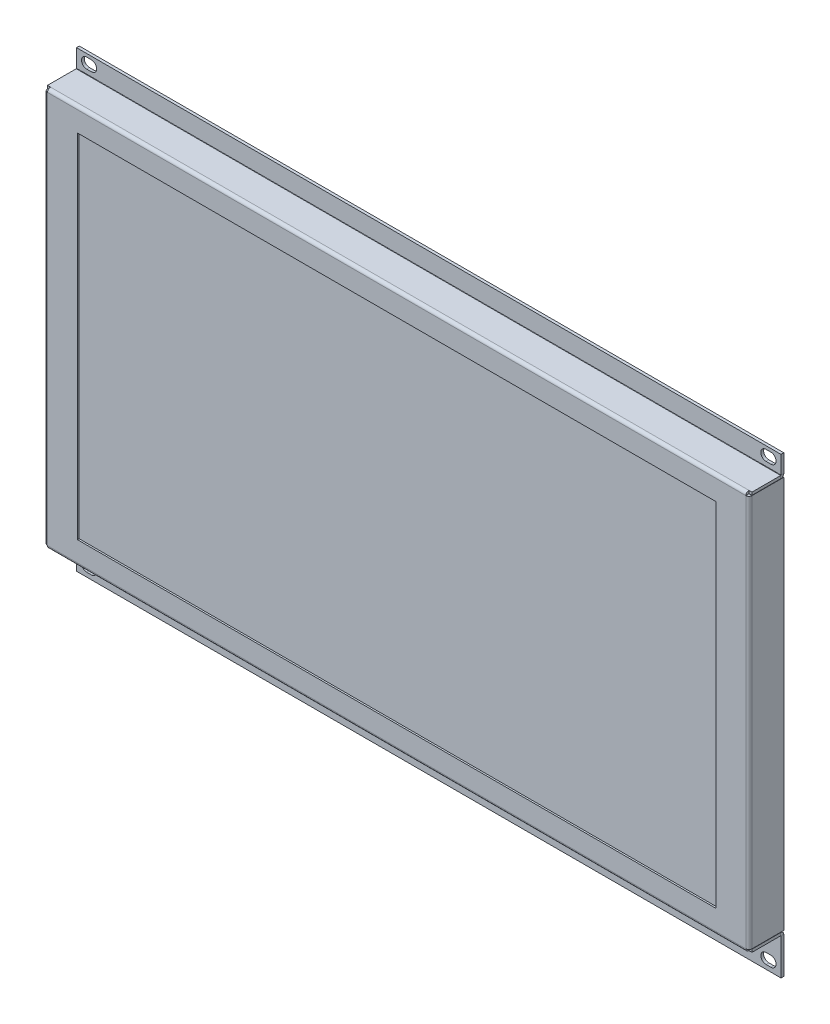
ISO-10303-21;
HEADER;
FILE_DESCRIPTION(('STEP AP214'),'2;1');
FILE_NAME('part.step','',(''),(''),'','','');
FILE_SCHEMA(('AUTOMOTIVE_DESIGN { 1 0 10303 214 1 1 1 1 }'));
ENDSEC;
DATA;
#1=APPLICATION_CONTEXT('core data for automotive mechanical design processes');
#2=APPLICATION_PROTOCOL_DEFINITION('international standard','automotive_design',2000,#1);
#3=PRODUCT_CONTEXT('',#1,'mechanical');
#4=PRODUCT('Part','Part','',(#3));
#5=PRODUCT_RELATED_PRODUCT_CATEGORY('part','',(#4));
#6=PRODUCT_DEFINITION_FORMATION('','',#4);
#7=PRODUCT_DEFINITION_CONTEXT('part definition',#1,'design');
#8=PRODUCT_DEFINITION('design','',#6,#7);
#9=PRODUCT_DEFINITION_SHAPE('','',#8);
#10=(LENGTH_UNIT() NAMED_UNIT(*) SI_UNIT(.MILLI.,.METRE.));
#11=(NAMED_UNIT(*) PLANE_ANGLE_UNIT() SI_UNIT($,.RADIAN.));
#12=(NAMED_UNIT(*) SI_UNIT($,.STERADIAN.) SOLID_ANGLE_UNIT());
#13=UNCERTAINTY_MEASURE_WITH_UNIT(LENGTH_MEASURE(1.E-05),#10,'distance_accuracy_value','');
#14=(GEOMETRIC_REPRESENTATION_CONTEXT(3) GLOBAL_UNCERTAINTY_ASSIGNED_CONTEXT((#13)) GLOBAL_UNIT_ASSIGNED_CONTEXT((#10,
#11,#12)) REPRESENTATION_CONTEXT('',''));
#15=CARTESIAN_POINT('',(0.,0.,0.));
#16=DIRECTION('',(0.,0.,1.));
#17=DIRECTION('',(1.,0.,0.));
#18=AXIS2_PLACEMENT_3D('',#15,#16,#17);
#19=CARTESIAN_POINT('',(0.,0.,-23.876));
#20=DIRECTION('',(0.,0.,1.));
#21=DIRECTION('',(0.,-1.,0.));
#22=AXIS2_PLACEMENT_3D('',#19,#20,#21);
#23=PLANE('',#22);
#24=DIRECTION('',(-1.,0.,0.));
#25=VECTOR('',#24,1.);
#26=CARTESIAN_POINT('',(-241.3,-136.7282,-23.876));
#27=LINE('',#26,#25);
#28=CARTESIAN_POINT('',(241.3,-136.7282,-23.8759999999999));
#29=VERTEX_POINT('',#28);
#30=CARTESIAN_POINT('',(200.66,-136.7282,-23.876));
#31=VERTEX_POINT('',#30);
#32=EDGE_CURVE('E885',#29,#31,#27,.T.);
#33=ORIENTED_EDGE('',*,*,#32,.F.);
#34=DIRECTION('',(0.,-1.,0.));
#35=VECTOR('',#34,1.);
#36=CARTESIAN_POINT('',(241.3,-2.91433543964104E-13,-23.876));
#37=LINE('',#36,#35);
#38=CARTESIAN_POINT('',(241.3,-161.67862,-23.8759999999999));
#39=VERTEX_POINT('',#38);
#40=EDGE_CURVE('E810',#29,#39,#37,.T.);
#41=ORIENTED_EDGE('',*,*,#40,.T.);
#42=DIRECTION('',(-1.,0.,0.));
#43=VECTOR('',#42,1.);
#44=CARTESIAN_POINT('',(0.,-161.67862,-23.876));
#45=LINE('',#44,#43);
#46=CARTESIAN_POINT('',(-241.3,-161.67862,-23.876));
#47=VERTEX_POINT('',#46);
#48=EDGE_CURVE('E808',#39,#47,#45,.T.);
#49=ORIENTED_EDGE('',*,*,#48,.T.);
#50=DIRECTION('',(0.,1.,0.));
#51=VECTOR('',#50,1.);
#52=CARTESIAN_POINT('',(-241.3,1.80411241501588E-13,-23.876));
#53=LINE('',#52,#51);
#54=CARTESIAN_POINT('',(-241.3,-136.7282,-23.876));
#55=VERTEX_POINT('',#54);
#56=EDGE_CURVE('E805',#47,#55,#53,.T.);
#57=ORIENTED_EDGE('',*,*,#56,.T.);
#58=DIRECTION('',(-1.,0.,0.));
#59=VECTOR('',#58,1.);
#60=CARTESIAN_POINT('',(-241.3,-136.7282,-23.876));
#61=LINE('',#60,#59);
#62=CARTESIAN_POINT('',(85.344,-136.7282,-23.876));
#63=VERTEX_POINT('',#62);
#64=EDGE_CURVE('E750',#63,#55,#61,.T.);
#65=ORIENTED_EDGE('',*,*,#64,.F.);
#66=DIRECTION('',(1.,0.,0.));
#67=VECTOR('',#66,1.);
#68=CARTESIAN_POINT('',(85.344,-136.7282,-23.876));
#69=LINE('',#68,#67);
#70=EDGE_CURVE('E802',#63,#31,#69,.T.);
#71=ORIENTED_EDGE('',*,*,#70,.T.);
#72=EDGE_LOOP('',(#33,#41,#49,#57,#65,#71));
#73=FACE_BOUND('',#72,.T.);
#74=DIRECTION('',(-1.,0.,0.));
#75=VECTOR('',#74,1.);
#76=CARTESIAN_POINT('',(85.344,-139.32662,-23.876));
#77=LINE('',#76,#75);
#78=CARTESIAN_POINT('',(200.66,-139.32662,-23.876));
#79=VERTEX_POINT('',#78);
#80=CARTESIAN_POINT('',(85.344,-139.32662,-23.876));
#81=VERTEX_POINT('',#80);
#82=EDGE_CURVE('E799',#79,#81,#77,.T.);
#83=ORIENTED_EDGE('',*,*,#82,.T.);
#84=DIRECTION('',(0.,-1.,0.));
#85=VECTOR('',#84,1.);
#86=CARTESIAN_POINT('',(85.344,-139.32662,-23.876));
#87=LINE('',#86,#85);
#88=CARTESIAN_POINT('',(85.344,-155.32862,-23.876));
#89=VERTEX_POINT('',#88);
#90=EDGE_CURVE('E796',#81,#89,#87,.T.);
#91=ORIENTED_EDGE('',*,*,#90,.T.);
#92=DIRECTION('',(1.,0.,0.));
#93=VECTOR('',#92,1.);
#94=CARTESIAN_POINT('',(85.344,-155.32862,-23.876));
#95=LINE('',#94,#93);
#96=CARTESIAN_POINT('',(200.66,-155.32862,-23.8759999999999));
#97=VERTEX_POINT('',#96);
#98=EDGE_CURVE('E793',#89,#97,#95,.T.);
#99=ORIENTED_EDGE('',*,*,#98,.T.);
#100=DIRECTION('',(0.,1.,0.));
#101=VECTOR('',#100,1.);
#102=CARTESIAN_POINT('',(200.66,-139.32662,-23.876));
#103=LINE('',#102,#101);
#104=EDGE_CURVE('E790',#97,#79,#103,.T.);
#105=ORIENTED_EDGE('',*,*,#104,.T.);
#106=EDGE_LOOP('',(#83,#91,#99,#105));
#107=FACE_BOUND('',#106,.T.);
#108=DIRECTION('',(-1.,0.,0.));
#109=VECTOR('',#108,1.);
#110=CARTESIAN_POINT('',(-234.3404,-151.63038,-23.876));
#111=LINE('',#110,#109);
#112=CARTESIAN_POINT('',(-231.0384,-151.63038,-23.876));
#113=VERTEX_POINT('',#112);
#114=CARTESIAN_POINT('',(-234.3404,-151.63038,-23.876));
#115=VERTEX_POINT('',#114);
#116=EDGE_CURVE('E787',#113,#115,#111,.T.);
#117=ORIENTED_EDGE('',*,*,#116,.T.);
#118=CARTESIAN_POINT('',(-234.3404,-155.18638,-23.876));
#119=DIRECTION('',(0.,0.,1.));
#120=DIRECTION('',(-1.,0.,0.));
#121=AXIS2_PLACEMENT_3D('',#118,#119,#120);
#122=CIRCLE('',#121,3.556);
#123=CARTESIAN_POINT('',(-234.3404,-158.74238,-23.876));
#124=VERTEX_POINT('',#123);
#125=EDGE_CURVE('E784',#115,#124,#122,.T.);
#126=ORIENTED_EDGE('',*,*,#125,.T.);
#127=DIRECTION('',(1.,0.,0.));
#128=VECTOR('',#127,1.);
#129=CARTESIAN_POINT('',(-231.0384,-158.74238,-23.876));
#130=LINE('',#129,#128);
#131=CARTESIAN_POINT('',(-231.0384,-158.74238,-23.876));
#132=VERTEX_POINT('',#131);
#133=EDGE_CURVE('E781',#124,#132,#130,.T.);
#134=ORIENTED_EDGE('',*,*,#133,.T.);
#135=CARTESIAN_POINT('',(-231.0384,-155.18638,-23.876));
#136=DIRECTION('',(0.,0.,1.));
#137=DIRECTION('',(-1.,0.,0.));
#138=AXIS2_PLACEMENT_3D('',#135,#136,#137);
#139=CIRCLE('',#138,3.556);
#140=EDGE_CURVE('E778',#132,#113,#139,.T.);
#141=ORIENTED_EDGE('',*,*,#140,.T.);
#142=EDGE_LOOP('',(#117,#126,#134,#141));
#143=FACE_BOUND('',#142,.T.);
#144=CARTESIAN_POINT('',(234.3404,-155.18638,-23.876));
#145=DIRECTION('',(0.,0.,-1.));
#146=DIRECTION('',(1.,0.,0.));
#147=AXIS2_PLACEMENT_3D('',#144,#145,#146);
#148=CIRCLE('',#147,3.556);
#149=CARTESIAN_POINT('',(234.3404,-151.63038,-23.876));
#150=VERTEX_POINT('',#149);
#151=CARTESIAN_POINT('',(234.3404,-158.74238,-23.876));
#152=VERTEX_POINT('',#151);
#153=EDGE_CURVE('E860',#150,#152,#148,.T.);
#154=ORIENTED_EDGE('',*,*,#153,.F.);
#155=DIRECTION('',(1.,0.,0.));
#156=VECTOR('',#155,1.);
#157=CARTESIAN_POINT('',(234.3404,-151.63038,-23.876));
#158=LINE('',#157,#156);
#159=CARTESIAN_POINT('',(231.0384,-151.63038,-23.8759999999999));
#160=VERTEX_POINT('',#159);
#161=EDGE_CURVE('E865',#160,#150,#158,.T.);
#162=ORIENTED_EDGE('',*,*,#161,.F.);
#163=CARTESIAN_POINT('',(231.0384,-155.18638,-23.876));
#164=DIRECTION('',(0.,0.,-1.));
#165=DIRECTION('',(1.,0.,0.));
#166=AXIS2_PLACEMENT_3D('',#163,#164,#165);
#167=CIRCLE('',#166,3.556);
#168=CARTESIAN_POINT('',(231.0384,-158.74238,-23.876));
#169=VERTEX_POINT('',#168);
#170=EDGE_CURVE('E869',#169,#160,#167,.T.);
#171=ORIENTED_EDGE('',*,*,#170,.F.);
#172=DIRECTION('',(-1.,0.,0.));
#173=VECTOR('',#172,1.);
#174=CARTESIAN_POINT('',(231.0384,-158.74238,-23.876));
#175=LINE('',#174,#173);
#176=EDGE_CURVE('E874',#152,#169,#175,.T.);
#177=ORIENTED_EDGE('',*,*,#176,.F.);
#178=EDGE_LOOP('',(#154,#162,#171,#177));
#179=FACE_BOUND('',#178,.T.);
#180=CARTESIAN_POINT('',(-55.372,-143.0782,-23.876));
#181=DIRECTION('',(0.,0.,-1.));
#182=DIRECTION('',(0.,1.,0.));
#183=AXIS2_PLACEMENT_3D('',#180,#181,#182);
#184=CIRCLE('',#183,2.0701);
#185=CARTESIAN_POINT('',(-55.372,-141.0081,-23.876));
#186=VERTEX_POINT('',#185);
#187=EDGE_CURVE('E744',#186,#186,#184,.T.);
#188=ORIENTED_EDGE('',*,*,#187,.F.);
#189=EDGE_LOOP('',(#188));
#190=FACE_BOUND('',#189,.T.);
#191=ADVANCED_FACE('F167',(#73,#107,#143,#179,#190),#23,.F.);
#192=CARTESIAN_POINT('',(241.3,-136.525,-1.89737999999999));
#193=DIRECTION('',(1.,0.,0.));
#194=DIRECTION('',(0.,1.,0.));
#195=AXIS2_PLACEMENT_3D('',#192,#193,#194);
#196=PLANE('',#195);
#197=DIRECTION('',(0.,0.,1.));
#198=VECTOR('',#197,1.);
#199=CARTESIAN_POINT('',(241.3,-136.525,-1.89737999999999));
#200=LINE('',#199,#198);
#201=CARTESIAN_POINT('',(241.3,-136.525,-2.10057999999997));
#202=VERTEX_POINT('',#201);
#203=CARTESIAN_POINT('',(241.3,-136.525,-21.77542));
#204=VERTEX_POINT('',#203);
#205=EDGE_CURVE('E1071',#202,#204,#200,.F.);
#206=ORIENTED_EDGE('',*,*,#205,.T.);
#207=DIRECTION('',(0.,1.,0.));
#208=VECTOR('',#207,1.);
#209=CARTESIAN_POINT('',(241.3,-136.525,-21.77542));
#210=LINE('',#209,#208);
#211=CARTESIAN_POINT('',(241.3,-134.62762,-21.77542));
#212=VERTEX_POINT('',#211);
#213=EDGE_CURVE('E1159',#204,#212,#210,.T.);
#214=ORIENTED_EDGE('',*,*,#213,.T.);
#215=DIRECTION('',(0.,0.,-1.));
#216=VECTOR('',#215,1.);
#217=CARTESIAN_POINT('',(241.3,-134.62762,5.17229465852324E-13));
#218=LINE('',#217,#216);
#219=CARTESIAN_POINT('',(241.3,-134.62762,-2.10057999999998));
#220=VERTEX_POINT('',#219);
#221=EDGE_CURVE('E1075',#220,#212,#218,.T.);
#222=ORIENTED_EDGE('',*,*,#221,.F.);
#223=DIRECTION('',(0.,-1.,0.));
#224=VECTOR('',#223,1.);
#225=CARTESIAN_POINT('',(241.3,-136.525,-2.10057999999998));
#226=LINE('',#225,#224);
#227=EDGE_CURVE('E1065',#220,#202,#226,.T.);
#228=ORIENTED_EDGE('',*,*,#227,.T.);
#229=EDGE_LOOP('',(#206,#214,#222,#228));
#230=FACE_BOUND('',#229,.T.);
#231=ADVANCED_FACE('F1245',(#230),#196,.T.);
#232=CARTESIAN_POINT('',(0.,-136.525,5.23854132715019E-13));
#233=DIRECTION('',(0.,1.,0.));
#234=DIRECTION('',(0.,0.,1.));
#235=AXIS2_PLACEMENT_3D('',#232,#233,#234);
#236=PLANE('',#235);
#237=DIRECTION('',(-1.,0.,0.));
#238=VECTOR('',#237,1.);
#239=CARTESIAN_POINT('',(241.3,-136.525,-21.77542));
#240=LINE('',#239,#238);
#241=CARTESIAN_POINT('',(-241.3,-136.525,-21.77542));
#242=VERTEX_POINT('',#241);
#243=EDGE_CURVE('E1162',#204,#242,#240,.T.);
#244=ORIENTED_EDGE('',*,*,#243,.F.);
#245=ORIENTED_EDGE('',*,*,#205,.F.);
#246=DIRECTION('',(-1.,0.,0.));
#247=VECTOR('',#246,1.);
#248=CARTESIAN_POINT('',(241.3,-136.525,-2.10057999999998));
#249=LINE('',#248,#247);
#250=CARTESIAN_POINT('',(239.19942,-136.525,-2.10057999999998));
#251=VERTEX_POINT('',#250);
#252=EDGE_CURVE('E1081',#251,#202,#249,.F.);
#253=ORIENTED_EDGE('',*,*,#252,.F.);
#254=CARTESIAN_POINT('',(-239.19942,-136.525,-2.10057999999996));
#255=VERTEX_POINT('',#254);
#256=EDGE_CURVE('E1080',#255,#251,#249,.F.);
#257=ORIENTED_EDGE('',*,*,#256,.F.);
#258=CARTESIAN_POINT('',(-241.3,-136.525,-2.10057999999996));
#259=VERTEX_POINT('',#258);
#260=EDGE_CURVE('E1077',#259,#255,#249,.F.);
#261=ORIENTED_EDGE('',*,*,#260,.F.);
#262=DIRECTION('',(0.,0.,-1.));
#263=VECTOR('',#262,1.);
#264=CARTESIAN_POINT('',(-241.3,-136.525,-23.876));
#265=LINE('',#264,#263);
#266=EDGE_CURVE('E1068',#242,#259,#265,.F.);
#267=ORIENTED_EDGE('',*,*,#266,.F.);
#268=EDGE_LOOP('',(#244,#245,#253,#257,#261,#267));
#269=FACE_BOUND('',#268,.T.);
#270=ADVANCED_FACE('F1251',(#269),#236,.F.);
#271=CARTESIAN_POINT('',(0.,-134.62762,5.17229465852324E-13));
#272=DIRECTION('',(0.,1.,0.));
#273=DIRECTION('',(0.,0.,1.));
#274=AXIS2_PLACEMENT_3D('',#271,#272,#273);
#275=PLANE('',#274);
#276=ORIENTED_EDGE('',*,*,#221,.T.);
#277=DIRECTION('',(-1.,0.,0.));
#278=VECTOR('',#277,1.);
#279=CARTESIAN_POINT('',(241.3,-134.62762,-21.77542));
#280=LINE('',#279,#278);
#281=CARTESIAN_POINT('',(-241.3,-134.62762,-21.77542));
#282=VERTEX_POINT('',#281);
#283=EDGE_CURVE('E1157',#212,#282,#280,.T.);
#284=ORIENTED_EDGE('',*,*,#283,.T.);
#285=DIRECTION('',(0.,0.,1.));
#286=VECTOR('',#285,1.);
#287=CARTESIAN_POINT('',(-241.3,-134.62762,5.17229465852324E-13));
#288=LINE('',#287,#286);
#289=CARTESIAN_POINT('',(-241.3,-134.62762,-2.10057999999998));
#290=VERTEX_POINT('',#289);
#291=EDGE_CURVE('E1073',#282,#290,#288,.T.);
#292=ORIENTED_EDGE('',*,*,#291,.T.);
#293=DIRECTION('',(-1.,0.,0.));
#294=VECTOR('',#293,1.);
#295=CARTESIAN_POINT('',(241.3,-134.62762,-2.10057999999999));
#296=LINE('',#295,#294);
#297=CARTESIAN_POINT('',(-239.19942,-134.62762,-2.10057999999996));
#298=VERTEX_POINT('',#297);
#299=EDGE_CURVE('E1089',#298,#290,#296,.T.);
#300=ORIENTED_EDGE('',*,*,#299,.F.);
#301=CARTESIAN_POINT('',(239.19942,-134.62762,-2.10057999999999));
#302=VERTEX_POINT('',#301);
#303=EDGE_CURVE('E1088',#302,#298,#296,.T.);
#304=ORIENTED_EDGE('',*,*,#303,.F.);
#305=EDGE_CURVE('E1085',#220,#302,#296,.T.);
#306=ORIENTED_EDGE('',*,*,#305,.F.);
#307=EDGE_LOOP('',(#276,#284,#292,#300,#304,#306));
#308=FACE_BOUND('',#307,.T.);
#309=ADVANCED_FACE('F1400',(#308),#275,.T.);
#310=CARTESIAN_POINT('',(-241.3,136.525,-23.876));
#311=DIRECTION('',(-1.,0.,0.));
#312=DIRECTION('',(0.,0.,1.));
#313=AXIS2_PLACEMENT_3D('',#310,#311,#312);
#314=PLANE('',#313);
#315=DIRECTION('',(0.,0.,-1.));
#316=VECTOR('',#315,1.);
#317=CARTESIAN_POINT('',(-241.3,136.525,-23.876));
#318=LINE('',#317,#316);
#319=CARTESIAN_POINT('',(-241.3,136.525,-2.10057999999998));
#320=VERTEX_POINT('',#319);
#321=CARTESIAN_POINT('',(-241.3,136.525,-21.77542));
#322=VERTEX_POINT('',#321);
#323=EDGE_CURVE('E190',#320,#322,#318,.T.);
#324=ORIENTED_EDGE('',*,*,#323,.T.);
#325=DIRECTION('',(0.,-1.,0.));
#326=VECTOR('',#325,1.);
#327=CARTESIAN_POINT('',(-241.3,136.525,-21.77542));
#328=LINE('',#327,#326);
#329=CARTESIAN_POINT('',(-241.3,134.62762,-21.77542));
#330=VERTEX_POINT('',#329);
#331=EDGE_CURVE('E1170',#322,#330,#328,.T.);
#332=ORIENTED_EDGE('',*,*,#331,.T.);
#333=DIRECTION('',(0.,0.,1.));
#334=VECTOR('',#333,1.);
#335=CARTESIAN_POINT('',(-241.3,134.62762,5.17229465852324E-13));
#336=LINE('',#335,#334);
#337=CARTESIAN_POINT('',(-241.3,134.62762,-2.10057999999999));
#338=VERTEX_POINT('',#337);
#339=EDGE_CURVE('E1103',#338,#330,#336,.F.);
#340=ORIENTED_EDGE('',*,*,#339,.F.);
#341=DIRECTION('',(0.,1.,0.));
#342=VECTOR('',#341,1.);
#343=CARTESIAN_POINT('',(-241.3,136.525,-2.10057999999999));
#344=LINE('',#343,#342);
#345=EDGE_CURVE('E1095',#338,#320,#344,.T.);
#346=ORIENTED_EDGE('',*,*,#345,.T.);
#347=EDGE_LOOP('',(#324,#332,#340,#346));
#348=FACE_BOUND('',#347,.T.);
#349=ADVANCED_FACE('F1404',(#348),#314,.T.);
#350=CARTESIAN_POINT('',(0.,136.525,5.23854132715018E-13));
#351=DIRECTION('',(0.,1.,0.));
#352=DIRECTION('',(0.,0.,1.));
#353=AXIS2_PLACEMENT_3D('',#350,#351,#352);
#354=PLANE('',#353);
#355=DIRECTION('',(0.,0.,1.));
#356=VECTOR('',#355,1.);
#357=CARTESIAN_POINT('',(241.3,136.525,-1.89737999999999));
#358=LINE('',#357,#356);
#359=CARTESIAN_POINT('',(241.3,136.525,-21.77542));
#360=VERTEX_POINT('',#359);
#361=CARTESIAN_POINT('',(241.3,136.525,-2.10057999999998));
#362=VERTEX_POINT('',#361);
#363=EDGE_CURVE('E182',#360,#362,#358,.T.);
#364=ORIENTED_EDGE('',*,*,#363,.F.);
#365=DIRECTION('',(1.,0.,0.));
#366=VECTOR('',#365,1.);
#367=CARTESIAN_POINT('',(-241.3,136.525,-21.77542));
#368=LINE('',#367,#366);
#369=EDGE_CURVE('E175',#322,#360,#368,.T.);
#370=ORIENTED_EDGE('',*,*,#369,.F.);
#371=ORIENTED_EDGE('',*,*,#323,.F.);
#372=DIRECTION('',(1.,0.,0.));
#373=VECTOR('',#372,1.);
#374=CARTESIAN_POINT('',(0.,136.525,-2.10057999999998));
#375=LINE('',#374,#373);
#376=CARTESIAN_POINT('',(-239.19942,136.525,-2.10057999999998));
#377=VERTEX_POINT('',#376);
#378=EDGE_CURVE('E1105',#320,#377,#375,.T.);
#379=ORIENTED_EDGE('',*,*,#378,.T.);
#380=CARTESIAN_POINT('',(239.19942,136.525,-2.10057999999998));
#381=VERTEX_POINT('',#380);
#382=EDGE_CURVE('E1108',#377,#381,#375,.T.);
#383=ORIENTED_EDGE('',*,*,#382,.T.);
#384=EDGE_CURVE('E1109',#381,#362,#375,.T.);
#385=ORIENTED_EDGE('',*,*,#384,.T.);
#386=EDGE_LOOP('',(#364,#370,#371,#379,#383,#385));
#387=FACE_BOUND('',#386,.T.);
#388=ADVANCED_FACE('F1420',(#387),#354,.T.);
#389=CARTESIAN_POINT('',(0.,134.62762,5.17229465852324E-13));
#390=DIRECTION('',(0.,1.,0.));
#391=DIRECTION('',(0.,0.,1.));
#392=AXIS2_PLACEMENT_3D('',#389,#390,#391);
#393=PLANE('',#392);
#394=DIRECTION('',(1.,0.,0.));
#395=VECTOR('',#394,1.);
#396=CARTESIAN_POINT('',(-241.3,134.62762,-21.77542));
#397=LINE('',#396,#395);
#398=CARTESIAN_POINT('',(241.3,134.62762,-21.77542));
#399=VERTEX_POINT('',#398);
#400=EDGE_CURVE('E1168',#330,#399,#397,.T.);
#401=ORIENTED_EDGE('',*,*,#400,.T.);
#402=DIRECTION('',(0.,0.,-1.));
#403=VECTOR('',#402,1.);
#404=CARTESIAN_POINT('',(241.3,134.62762,5.17229465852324E-13));
#405=LINE('',#404,#403);
#406=CARTESIAN_POINT('',(241.3,134.62762,-2.10057999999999));
#407=VERTEX_POINT('',#406);
#408=EDGE_CURVE('E1101',#399,#407,#405,.F.);
#409=ORIENTED_EDGE('',*,*,#408,.T.);
#410=DIRECTION('',(-1.,0.,0.));
#411=VECTOR('',#410,1.);
#412=CARTESIAN_POINT('',(-241.3,134.62762,-2.10057999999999));
#413=LINE('',#412,#411);
#414=CARTESIAN_POINT('',(239.19942,134.62762,-2.10057999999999));
#415=VERTEX_POINT('',#414);
#416=EDGE_CURVE('E1117',#415,#407,#413,.F.);
#417=ORIENTED_EDGE('',*,*,#416,.F.);
#418=CARTESIAN_POINT('',(-239.19942,134.62762,-2.10057999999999));
#419=VERTEX_POINT('',#418);
#420=EDGE_CURVE('E1116',#419,#415,#413,.F.);
#421=ORIENTED_EDGE('',*,*,#420,.F.);
#422=EDGE_CURVE('E1113',#338,#419,#413,.F.);
#423=ORIENTED_EDGE('',*,*,#422,.F.);
#424=ORIENTED_EDGE('',*,*,#339,.T.);
#425=EDGE_LOOP('',(#401,#409,#417,#421,#423,#424));
#426=FACE_BOUND('',#425,.T.);
#427=ADVANCED_FACE('F1423',(#426),#393,.F.);
#428=CARTESIAN_POINT('',(0.,0.,-2.10058000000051));
#429=DIRECTION('',(0.,0.,1.));
#430=DIRECTION('',(0.,-1.,0.));
#431=AXIS2_PLACEMENT_3D('',#428,#429,#430);
#432=PLANE('',#431);
#433=DIRECTION('',(0.,-1.,0.));
#434=VECTOR('',#433,1.);
#435=CARTESIAN_POINT('',(-239.19942,136.525,-2.10057999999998));
#436=LINE('',#435,#434);
#437=EDGE_CURVE('E1155',#377,#419,#436,.T.);
#438=ORIENTED_EDGE('',*,*,#437,.F.);
#439=ORIENTED_EDGE('',*,*,#378,.F.);
#440=ORIENTED_EDGE('',*,*,#345,.F.);
#441=ORIENTED_EDGE('',*,*,#422,.T.);
#442=EDGE_LOOP('',(#438,#439,#440,#441));
#443=FACE_BOUND('',#442,.T.);
#444=ADVANCED_FACE('F169',(#443),#432,.T.);
#445=CARTESIAN_POINT('',(241.3,134.42442,-2.10057999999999));
#446=DIRECTION('',(1.,0.,0.));
#447=DIRECTION('',(0.,1.,0.));
#448=AXIS2_PLACEMENT_3D('',#445,#446,#447);
#449=CYLINDRICAL_SURFACE('',#448,2.10057999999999);
#450=ORIENTED_EDGE('',*,*,#382,.F.);
#451=CARTESIAN_POINT('',(-239.19942,134.42442,-2.10057999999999));
#452=DIRECTION('',(-1.,0.,0.));
#453=DIRECTION('',(0.,0.,1.));
#454=AXIS2_PLACEMENT_3D('',#451,#452,#453);
#455=CIRCLE('',#454,2.10057999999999);
#456=CARTESIAN_POINT('',(-239.19942,134.42442,0.));
#457=VERTEX_POINT('',#456);
#458=EDGE_CURVE('E1149',#377,#457,#455,.F.);
#459=ORIENTED_EDGE('',*,*,#458,.T.);
#460=DIRECTION('',(1.,0.,0.));
#461=VECTOR('',#460,1.);
#462=CARTESIAN_POINT('',(241.3,134.42442,0.));
#463=LINE('',#462,#461);
#464=CARTESIAN_POINT('',(239.19942,134.42442,0.));
#465=VERTEX_POINT('',#464);
#466=EDGE_CURVE('E1119',#465,#457,#463,.F.);
#467=ORIENTED_EDGE('',*,*,#466,.F.);
#468=CARTESIAN_POINT('',(239.19942,134.42442,-2.10057999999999));
#469=DIRECTION('',(1.,0.,0.));
#470=DIRECTION('',(0.,0.,-1.));
#471=AXIS2_PLACEMENT_3D('',#468,#469,#470);
#472=CIRCLE('',#471,2.10057999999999);
#473=EDGE_CURVE('E1127',#465,#381,#472,.F.);
#474=ORIENTED_EDGE('',*,*,#473,.T.);
#475=EDGE_LOOP('',(#450,#459,#467,#474));
#476=FACE_BOUND('',#475,.T.);
#477=ADVANCED_FACE('F1434',(#476),#449,.T.);
#478=CARTESIAN_POINT('',(0.,0.,-2.1005800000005));
#479=DIRECTION('',(0.,0.,-1.));
#480=DIRECTION('',(0.,1.,0.));
#481=AXIS2_PLACEMENT_3D('',#478,#479,#480);
#482=PLANE('',#481);
#483=DIRECTION('',(0.,-1.,0.));
#484=VECTOR('',#483,1.);
#485=CARTESIAN_POINT('',(-239.19942,-134.62762,-2.10057999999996));
#486=LINE('',#485,#484);
#487=EDGE_CURVE('E1147',#298,#255,#486,.T.);
#488=ORIENTED_EDGE('',*,*,#487,.F.);
#489=ORIENTED_EDGE('',*,*,#299,.T.);
#490=DIRECTION('',(0.,-1.,0.));
#491=VECTOR('',#490,1.);
#492=CARTESIAN_POINT('',(-241.3,-134.62762,-2.10057999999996));
#493=LINE('',#492,#491);
#494=EDGE_CURVE('E1082',#290,#259,#493,.T.);
#495=ORIENTED_EDGE('',*,*,#494,.T.);
#496=ORIENTED_EDGE('',*,*,#260,.T.);
#497=EDGE_LOOP('',(#488,#489,#495,#496));
#498=FACE_BOUND('',#497,.T.);
#499=ADVANCED_FACE('F1414',(#498),#482,.F.);
#500=CARTESIAN_POINT('',(-241.3,-134.42442,-2.10057999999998));
#501=DIRECTION('',(-1.,0.,0.));
#502=DIRECTION('',(0.,-1.,0.));
#503=AXIS2_PLACEMENT_3D('',#500,#501,#502);
#504=CYLINDRICAL_SURFACE('',#503,2.10057999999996);
#505=DIRECTION('',(-1.,0.,0.));
#506=VECTOR('',#505,1.);
#507=CARTESIAN_POINT('',(-241.3,-134.42442,0.));
#508=LINE('',#507,#506);
#509=CARTESIAN_POINT('',(-239.19942,-134.42442,0.));
#510=VERTEX_POINT('',#509);
#511=CARTESIAN_POINT('',(239.19942,-134.42442,0.));
#512=VERTEX_POINT('',#511);
#513=EDGE_CURVE('E1092',#510,#512,#508,.F.);
#514=ORIENTED_EDGE('',*,*,#513,.F.);
#515=CARTESIAN_POINT('',(-239.19942,-134.42442,-2.10057999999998));
#516=DIRECTION('',(-1.,0.,0.));
#517=DIRECTION('',(0.,0.,1.));
#518=AXIS2_PLACEMENT_3D('',#515,#516,#517);
#519=CIRCLE('',#518,2.10057999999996);
#520=EDGE_CURVE('E1144',#510,#255,#519,.F.);
#521=ORIENTED_EDGE('',*,*,#520,.T.);
#522=ORIENTED_EDGE('',*,*,#256,.T.);
#523=CARTESIAN_POINT('',(239.19942,-134.42442,-2.10057999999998));
#524=DIRECTION('',(1.,0.,0.));
#525=DIRECTION('',(0.,0.,-1.));
#526=AXIS2_PLACEMENT_3D('',#523,#524,#525);
#527=CIRCLE('',#526,2.10057999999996);
#528=EDGE_CURVE('E1133',#251,#512,#527,.F.);
#529=ORIENTED_EDGE('',*,*,#528,.T.);
#530=EDGE_LOOP('',(#514,#521,#522,#529));
#531=FACE_BOUND('',#530,.T.);
#532=ADVANCED_FACE('F1410',(#531),#504,.T.);
#533=CARTESIAN_POINT('',(-239.19942,-134.42442,-2.10057999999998));
#534=DIRECTION('',(-1.,0.,0.));
#535=DIRECTION('',(0.,0.,1.));
#536=AXIS2_PLACEMENT_3D('',#533,#534,#535);
#537=PLANE('',#536);
#538=CARTESIAN_POINT('',(-239.19942,-134.42442,-2.10057999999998));
#539=DIRECTION('',(-1.,0.,0.));
#540=DIRECTION('',(0.,0.,1.));
#541=AXIS2_PLACEMENT_3D('',#538,#539,#540);
#542=CIRCLE('',#541,0.203199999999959);
#543=CARTESIAN_POINT('',(-239.19942,-134.42442,-1.89738000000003));
#544=VERTEX_POINT('',#543);
#545=EDGE_CURVE('E1141',#544,#298,#542,.F.);
#546=ORIENTED_EDGE('',*,*,#545,.T.);
#547=ORIENTED_EDGE('',*,*,#487,.T.);
#548=ORIENTED_EDGE('',*,*,#520,.F.);
#549=DIRECTION('',(0.,0.,1.));
#550=VECTOR('',#549,1.);
#551=CARTESIAN_POINT('',(-239.19942,-134.42442,-1.89738000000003));
#552=LINE('',#551,#550);
#553=EDGE_CURVE('E1007',#544,#510,#552,.T.);
#554=ORIENTED_EDGE('',*,*,#553,.F.);
#555=EDGE_LOOP('',(#546,#547,#548,#554));
#556=FACE_BOUND('',#555,.T.);
#557=ADVANCED_FACE('F1413',(#556),#537,.T.);
#558=CARTESIAN_POINT('',(0.,0.,-1.89738));
#559=DIRECTION('',(0.,0.,1.));
#560=DIRECTION('',(1.,0.,0.));
#561=AXIS2_PLACEMENT_3D('',#558,#559,#560);
#562=PLANE('',#561);
#563=DIRECTION('',(0.,1.,0.));
#564=VECTOR('',#563,1.);
#565=CARTESIAN_POINT('',(-239.19942,134.42442,-1.89738000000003));
#566=LINE('',#565,#564);
#567=CARTESIAN_POINT('',(-239.19942,134.42442,-1.89738000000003));
#568=VERTEX_POINT('',#567);
#569=EDGE_CURVE('E1003',#568,#544,#566,.F.);
#570=ORIENTED_EDGE('',*,*,#569,.F.);
#571=DIRECTION('',(1.,0.,0.));
#572=VECTOR('',#571,1.);
#573=CARTESIAN_POINT('',(241.3,134.42442,-1.89738));
#574=LINE('',#573,#572);
#575=CARTESIAN_POINT('',(239.19942,134.42442,-1.89738));
#576=VERTEX_POINT('',#575);
#577=EDGE_CURVE('E1099',#576,#568,#574,.F.);
#578=ORIENTED_EDGE('',*,*,#577,.F.);
#579=DIRECTION('',(0.,-1.,0.));
#580=VECTOR('',#579,1.);
#581=CARTESIAN_POINT('',(239.19942,-134.42442,-1.89738));
#582=LINE('',#581,#580);
#583=CARTESIAN_POINT('',(239.19942,-134.42442,-1.89738));
#584=VERTEX_POINT('',#583);
#585=EDGE_CURVE('E1058',#584,#576,#582,.F.);
#586=ORIENTED_EDGE('',*,*,#585,.F.);
#587=DIRECTION('',(-1.,0.,0.));
#588=VECTOR('',#587,1.);
#589=CARTESIAN_POINT('',(-241.3,-134.42442,-1.89738000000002));
#590=LINE('',#589,#588);
#591=EDGE_CURVE('E1070',#544,#584,#590,.F.);
#592=ORIENTED_EDGE('',*,*,#591,.F.);
#593=EDGE_LOOP('',(#570,#578,#586,#592));
#594=FACE_BOUND('',#593,.T.);
#595=ADVANCED_FACE('F1442',(#594),#562,.F.);
#596=CARTESIAN_POINT('',(0.,0.,0.));
#597=DIRECTION('',(0.,0.,1.));
#598=DIRECTION('',(1.,0.,0.));
#599=AXIS2_PLACEMENT_3D('',#596,#597,#598);
#600=PLANE('',#599);
#601=DIRECTION('',(0.,-1.,0.));
#602=VECTOR('',#601,1.);
#603=CARTESIAN_POINT('',(-218.694,120.65,0.));
#604=LINE('',#603,#602);
#605=CARTESIAN_POINT('',(-218.694,120.65,0.));
#606=VERTEX_POINT('',#605);
#607=CARTESIAN_POINT('',(-218.694,-120.65,0.));
#608=VERTEX_POINT('',#607);
#609=EDGE_CURVE('E925',#606,#608,#604,.T.);
#610=ORIENTED_EDGE('',*,*,#609,.F.);
#611=DIRECTION('',(-1.,0.,0.));
#612=VECTOR('',#611,1.);
#613=CARTESIAN_POINT('',(-218.694,120.65,0.));
#614=LINE('',#613,#612);
#615=CARTESIAN_POINT('',(218.694,120.65,0.));
#616=VERTEX_POINT('',#615);
#617=EDGE_CURVE('E931',#616,#606,#614,.T.);
#618=ORIENTED_EDGE('',*,*,#617,.F.);
#619=DIRECTION('',(0.,1.,0.));
#620=VECTOR('',#619,1.);
#621=CARTESIAN_POINT('',(218.694,120.65,0.));
#622=LINE('',#621,#620);
#623=CARTESIAN_POINT('',(218.694,-120.65,0.));
#624=VERTEX_POINT('',#623);
#625=EDGE_CURVE('E945',#624,#616,#622,.T.);
#626=ORIENTED_EDGE('',*,*,#625,.F.);
#627=DIRECTION('',(1.,0.,0.));
#628=VECTOR('',#627,1.);
#629=CARTESIAN_POINT('',(-218.694,-120.65,0.));
#630=LINE('',#629,#628);
#631=EDGE_CURVE('E942',#608,#624,#630,.T.);
#632=ORIENTED_EDGE('',*,*,#631,.F.);
#633=EDGE_LOOP('',(#610,#618,#626,#632));
#634=FACE_BOUND('',#633,.T.);
#635=ORIENTED_EDGE('',*,*,#466,.T.);
#636=DIRECTION('',(0.,1.,0.));
#637=VECTOR('',#636,1.);
#638=CARTESIAN_POINT('',(-239.19942,134.42442,0.));
#639=LINE('',#638,#637);
#640=EDGE_CURVE('E990',#457,#510,#639,.F.);
#641=ORIENTED_EDGE('',*,*,#640,.T.);
#642=ORIENTED_EDGE('',*,*,#513,.T.);
#643=DIRECTION('',(0.,-1.,0.));
#644=VECTOR('',#643,1.);
#645=CARTESIAN_POINT('',(239.19942,-134.42442,0.));
#646=LINE('',#645,#644);
#647=EDGE_CURVE('E1045',#512,#465,#646,.F.);
#648=ORIENTED_EDGE('',*,*,#647,.T.);
#649=EDGE_LOOP('',(#635,#641,#642,#648));
#650=FACE_BOUND('',#649,.T.);
#651=ADVANCED_FACE('F1445',(#634,#650),#600,.T.);
#652=CARTESIAN_POINT('',(0.,0.,-2.1005800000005));
#653=DIRECTION('',(0.,0.,1.));
#654=DIRECTION('',(0.,-1.,0.));
#655=AXIS2_PLACEMENT_3D('',#652,#653,#654);
#656=PLANE('',#655);
#657=DIRECTION('',(0.,1.,0.));
#658=VECTOR('',#657,1.);
#659=CARTESIAN_POINT('',(239.19942,-136.525,-2.10057999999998));
#660=LINE('',#659,#658);
#661=EDGE_CURVE('E1139',#251,#302,#660,.T.);
#662=ORIENTED_EDGE('',*,*,#661,.F.);
#663=ORIENTED_EDGE('',*,*,#252,.T.);
#664=ORIENTED_EDGE('',*,*,#227,.F.);
#665=ORIENTED_EDGE('',*,*,#305,.T.);
#666=EDGE_LOOP('',(#662,#663,#664,#665));
#667=FACE_BOUND('',#666,.T.);
#668=ADVANCED_FACE('F1449',(#667),#656,.T.);
#669=CARTESIAN_POINT('',(0.,0.,-2.10058000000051));
#670=DIRECTION('',(0.,0.,1.));
#671=DIRECTION('',(0.,-1.,0.));
#672=AXIS2_PLACEMENT_3D('',#669,#670,#671);
#673=PLANE('',#672);
#674=DIRECTION('',(0.,1.,0.));
#675=VECTOR('',#674,1.);
#676=CARTESIAN_POINT('',(239.19942,134.62762,-2.10057999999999));
#677=LINE('',#676,#675);
#678=EDGE_CURVE('E1130',#415,#381,#677,.T.);
#679=ORIENTED_EDGE('',*,*,#678,.F.);
#680=ORIENTED_EDGE('',*,*,#416,.T.);
#681=DIRECTION('',(0.,1.,0.));
#682=VECTOR('',#681,1.);
#683=CARTESIAN_POINT('',(241.3,134.62762,-2.10057999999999));
#684=LINE('',#683,#682);
#685=EDGE_CURVE('E1110',#407,#362,#684,.T.);
#686=ORIENTED_EDGE('',*,*,#685,.T.);
#687=ORIENTED_EDGE('',*,*,#384,.F.);
#688=EDGE_LOOP('',(#679,#680,#686,#687));
#689=FACE_BOUND('',#688,.T.);
#690=ADVANCED_FACE('F1455',(#689),#673,.T.);
#691=CARTESIAN_POINT('',(-239.19942,134.42442,-2.10057999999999));
#692=DIRECTION('',(-1.,0.,0.));
#693=DIRECTION('',(0.,0.,1.));
#694=AXIS2_PLACEMENT_3D('',#691,#692,#693);
#695=PLANE('',#694);
#696=ORIENTED_EDGE('',*,*,#458,.F.);
#697=ORIENTED_EDGE('',*,*,#437,.T.);
#698=CARTESIAN_POINT('',(-239.19942,134.42442,-2.10057999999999));
#699=DIRECTION('',(-1.,0.,0.));
#700=DIRECTION('',(0.,0.,1.));
#701=AXIS2_PLACEMENT_3D('',#698,#699,#700);
#702=CIRCLE('',#701,0.203199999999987);
#703=EDGE_CURVE('E1152',#419,#568,#702,.F.);
#704=ORIENTED_EDGE('',*,*,#703,.T.);
#705=DIRECTION('',(0.,0.,1.));
#706=VECTOR('',#705,1.);
#707=CARTESIAN_POINT('',(-239.19942,134.42442,-1.89738000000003));
#708=LINE('',#707,#706);
#709=EDGE_CURVE('E997',#568,#457,#708,.T.);
#710=ORIENTED_EDGE('',*,*,#709,.T.);
#711=EDGE_LOOP('',(#696,#697,#704,#710));
#712=FACE_BOUND('',#711,.T.);
#713=ADVANCED_FACE('F1453',(#712),#695,.T.);
#714=CARTESIAN_POINT('',(239.19942,134.42442,-2.10057999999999));
#715=DIRECTION('',(1.,0.,0.));
#716=DIRECTION('',(0.,0.,-1.));
#717=AXIS2_PLACEMENT_3D('',#714,#715,#716);
#718=PLANE('',#717);
#719=CARTESIAN_POINT('',(239.19942,134.42442,-2.10057999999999));
#720=DIRECTION('',(1.,0.,0.));
#721=DIRECTION('',(0.,0.,-1.));
#722=AXIS2_PLACEMENT_3D('',#719,#720,#721);
#723=CIRCLE('',#722,0.203199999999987);
#724=EDGE_CURVE('E1122',#576,#415,#723,.F.);
#725=ORIENTED_EDGE('',*,*,#724,.T.);
#726=ORIENTED_EDGE('',*,*,#678,.T.);
#727=ORIENTED_EDGE('',*,*,#473,.F.);
#728=DIRECTION('',(0.,0.,1.));
#729=VECTOR('',#728,1.);
#730=CARTESIAN_POINT('',(239.19942,134.42442,-1.89738));
#731=LINE('',#730,#729);
#732=EDGE_CURVE('E1062',#576,#465,#731,.T.);
#733=ORIENTED_EDGE('',*,*,#732,.F.);
#734=EDGE_LOOP('',(#725,#726,#727,#733));
#735=FACE_BOUND('',#734,.T.);
#736=ADVANCED_FACE('F1440',(#735),#718,.T.);
#737=CARTESIAN_POINT('',(241.3,134.42442,-2.10057999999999));
#738=DIRECTION('',(1.,0.,0.));
#739=DIRECTION('',(0.,1.,0.));
#740=AXIS2_PLACEMENT_3D('',#737,#738,#739);
#741=CYLINDRICAL_SURFACE('',#740,0.203199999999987);
#742=ORIENTED_EDGE('',*,*,#703,.F.);
#743=ORIENTED_EDGE('',*,*,#420,.T.);
#744=ORIENTED_EDGE('',*,*,#724,.F.);
#745=ORIENTED_EDGE('',*,*,#577,.T.);
#746=EDGE_LOOP('',(#742,#743,#744,#745));
#747=FACE_BOUND('',#746,.T.);
#748=ADVANCED_FACE('F1430',(#747),#741,.F.);
#749=CARTESIAN_POINT('',(241.3,136.525,-1.89737999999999));
#750=DIRECTION('',(1.,0.,0.));
#751=DIRECTION('',(0.,0.,-1.));
#752=AXIS2_PLACEMENT_3D('',#749,#750,#751);
#753=PLANE('',#752);
#754=DIRECTION('',(0.,-1.,0.));
#755=VECTOR('',#754,1.);
#756=CARTESIAN_POINT('',(241.3,136.525,-21.77542));
#757=LINE('',#756,#755);
#758=EDGE_CURVE('E13',#360,#399,#757,.T.);
#759=ORIENTED_EDGE('',*,*,#758,.F.);
#760=ORIENTED_EDGE('',*,*,#363,.T.);
#761=ORIENTED_EDGE('',*,*,#685,.F.);
#762=ORIENTED_EDGE('',*,*,#408,.F.);
#763=EDGE_LOOP('',(#759,#760,#761,#762));
#764=FACE_BOUND('',#763,.T.);
#765=ADVANCED_FACE('F1427',(#764),#753,.T.);
#766=CARTESIAN_POINT('',(239.19942,-134.42442,-2.10057999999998));
#767=DIRECTION('',(1.,0.,0.));
#768=DIRECTION('',(0.,0.,-1.));
#769=AXIS2_PLACEMENT_3D('',#766,#767,#768);
#770=PLANE('',#769);
#771=ORIENTED_EDGE('',*,*,#528,.F.);
#772=ORIENTED_EDGE('',*,*,#661,.T.);
#773=CARTESIAN_POINT('',(239.19942,-134.42442,-2.10057999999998));
#774=DIRECTION('',(1.,0.,0.));
#775=DIRECTION('',(0.,0.,-1.));
#776=AXIS2_PLACEMENT_3D('',#773,#774,#775);
#777=CIRCLE('',#776,0.203199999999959);
#778=EDGE_CURVE('E1136',#302,#584,#777,.F.);
#779=ORIENTED_EDGE('',*,*,#778,.T.);
#780=DIRECTION('',(0.,0.,1.));
#781=VECTOR('',#780,1.);
#782=CARTESIAN_POINT('',(239.19942,-134.42442,-1.89738));
#783=LINE('',#782,#781);
#784=EDGE_CURVE('E1052',#584,#512,#783,.T.);
#785=ORIENTED_EDGE('',*,*,#784,.T.);
#786=EDGE_LOOP('',(#771,#772,#779,#785));
#787=FACE_BOUND('',#786,.T.);
#788=ADVANCED_FACE('F1418',(#787),#770,.T.);
#789=CARTESIAN_POINT('',(-241.3,-134.42442,-2.10057999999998));
#790=DIRECTION('',(-1.,0.,0.));
#791=DIRECTION('',(0.,-1.,0.));
#792=AXIS2_PLACEMENT_3D('',#789,#790,#791);
#793=CYLINDRICAL_SURFACE('',#792,0.203199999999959);
#794=ORIENTED_EDGE('',*,*,#545,.F.);
#795=ORIENTED_EDGE('',*,*,#591,.T.);
#796=ORIENTED_EDGE('',*,*,#778,.F.);
#797=ORIENTED_EDGE('',*,*,#303,.T.);
#798=EDGE_LOOP('',(#794,#795,#796,#797));
#799=FACE_BOUND('',#798,.T.);
#800=ADVANCED_FACE('F1407',(#799),#793,.F.);
#801=CARTESIAN_POINT('',(-241.3,-136.525,-23.876));
#802=DIRECTION('',(-1.,0.,0.));
#803=DIRECTION('',(0.,-1.,0.));
#804=AXIS2_PLACEMENT_3D('',#801,#802,#803);
#805=PLANE('',#804);
#806=DIRECTION('',(0.,1.,0.));
#807=VECTOR('',#806,1.);
#808=CARTESIAN_POINT('',(-241.3,-136.525,-21.77542));
#809=LINE('',#808,#807);
#810=EDGE_CURVE('E1165',#242,#282,#809,.T.);
#811=ORIENTED_EDGE('',*,*,#810,.F.);
#812=ORIENTED_EDGE('',*,*,#266,.T.);
#813=ORIENTED_EDGE('',*,*,#494,.F.);
#814=ORIENTED_EDGE('',*,*,#291,.F.);
#815=EDGE_LOOP('',(#811,#812,#813,#814));
#816=FACE_BOUND('',#815,.T.);
#817=ADVANCED_FACE('F1393',(#816),#805,.T.);
#818=CARTESIAN_POINT('',(239.19942,134.42442,-2.10057999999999));
#819=DIRECTION('',(0.,1.,0.));
#820=DIRECTION('',(0.,0.,1.));
#821=AXIS2_PLACEMENT_3D('',#818,#819,#820);
#822=PLANE('',#821);
#823=DIRECTION('',(1.,0.,0.));
#824=VECTOR('',#823,1.);
#825=CARTESIAN_POINT('',(241.3,134.42442,-2.10057999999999));
#826=LINE('',#825,#824);
#827=CARTESIAN_POINT('',(239.40262,134.42442,-2.10057999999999));
#828=VERTEX_POINT('',#827);
#829=CARTESIAN_POINT('',(241.3,134.42442,-2.10057999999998));
#830=VERTEX_POINT('',#829);
#831=EDGE_CURVE('E1010',#828,#830,#826,.T.);
#832=ORIENTED_EDGE('',*,*,#831,.F.);
#833=CARTESIAN_POINT('',(239.19942,134.42442,-2.10057999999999));
#834=DIRECTION('',(0.,-1.,0.));
#835=DIRECTION('',(0.,0.,-1.));
#836=AXIS2_PLACEMENT_3D('',#833,#834,#835);
#837=CIRCLE('',#836,0.203199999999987);
#838=EDGE_CURVE('E1055',#576,#828,#837,.F.);
#839=ORIENTED_EDGE('',*,*,#838,.F.);
#840=ORIENTED_EDGE('',*,*,#732,.T.);
#841=CARTESIAN_POINT('',(239.19942,134.42442,-2.10057999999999));
#842=DIRECTION('',(0.,-1.,0.));
#843=DIRECTION('',(0.,0.,-1.));
#844=AXIS2_PLACEMENT_3D('',#841,#842,#843);
#845=CIRCLE('',#844,2.10057999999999);
#846=EDGE_CURVE('E1048',#465,#830,#845,.F.);
#847=ORIENTED_EDGE('',*,*,#846,.T.);
#848=EDGE_LOOP('',(#832,#839,#840,#847));
#849=FACE_BOUND('',#848,.T.);
#850=ADVANCED_FACE('F1390',(#849),#822,.T.);
#851=CARTESIAN_POINT('',(239.19942,-134.42442,-2.10057999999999));
#852=DIRECTION('',(0.,1.,0.));
#853=DIRECTION('',(0.,0.,1.));
#854=AXIS2_PLACEMENT_3D('',#851,#852,#853);
#855=PLANE('',#854);
#856=CARTESIAN_POINT('',(239.19942,-134.42442,-2.10057999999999));
#857=DIRECTION('',(0.,-1.,0.));
#858=DIRECTION('',(0.,0.,-1.));
#859=AXIS2_PLACEMENT_3D('',#856,#857,#858);
#860=CIRCLE('',#859,0.203199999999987);
#861=CARTESIAN_POINT('',(239.40262,-134.42442,-2.10057999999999));
#862=VERTEX_POINT('',#861);
#863=EDGE_CURVE('E1015',#862,#584,#860,.T.);
#864=ORIENTED_EDGE('',*,*,#863,.F.);
#865=DIRECTION('',(1.,0.,0.));
#866=VECTOR('',#865,1.);
#867=CARTESIAN_POINT('',(239.40262,-134.42442,-2.10057999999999));
#868=LINE('',#867,#866);
#869=CARTESIAN_POINT('',(241.3,-134.42442,-2.10057999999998));
#870=VERTEX_POINT('',#869);
#871=EDGE_CURVE('E1038',#862,#870,#868,.T.);
#872=ORIENTED_EDGE('',*,*,#871,.T.);
#873=CARTESIAN_POINT('',(239.19942,-134.42442,-2.10057999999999));
#874=DIRECTION('',(0.,-1.,0.));
#875=DIRECTION('',(0.,0.,-1.));
#876=AXIS2_PLACEMENT_3D('',#873,#874,#875);
#877=CIRCLE('',#876,2.10057999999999);
#878=EDGE_CURVE('E1049',#870,#512,#877,.T.);
#879=ORIENTED_EDGE('',*,*,#878,.T.);
#880=ORIENTED_EDGE('',*,*,#784,.F.);
#881=EDGE_LOOP('',(#864,#872,#879,#880));
#882=FACE_BOUND('',#881,.T.);
#883=ADVANCED_FACE('F1385',(#882),#855,.F.);
#884=CARTESIAN_POINT('',(239.19942,-134.42442,-2.10057999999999));
#885=DIRECTION('',(0.,-1.,0.));
#886=DIRECTION('',(1.,0.,0.));
#887=AXIS2_PLACEMENT_3D('',#884,#885,#886);
#888=CYLINDRICAL_SURFACE('',#887,2.10057999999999);
#889=ORIENTED_EDGE('',*,*,#647,.F.);
#890=ORIENTED_EDGE('',*,*,#878,.F.);
#891=DIRECTION('',(0.,-1.,0.));
#892=VECTOR('',#891,1.);
#893=CARTESIAN_POINT('',(241.3,0.,-2.10057999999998));
#894=LINE('',#893,#892);
#895=EDGE_CURVE('E1035',#830,#870,#894,.T.);
#896=ORIENTED_EDGE('',*,*,#895,.F.);
#897=ORIENTED_EDGE('',*,*,#846,.F.);
#898=EDGE_LOOP('',(#889,#890,#896,#897));
#899=FACE_BOUND('',#898,.T.);
#900=ADVANCED_FACE('F1382',(#899),#888,.T.);
#901=CARTESIAN_POINT('',(239.19942,-134.42442,-2.10057999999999));
#902=DIRECTION('',(0.,-1.,0.));
#903=DIRECTION('',(1.,0.,0.));
#904=AXIS2_PLACEMENT_3D('',#901,#902,#903);
#905=CYLINDRICAL_SURFACE('',#904,0.203199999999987);
#906=ORIENTED_EDGE('',*,*,#585,.T.);
#907=ORIENTED_EDGE('',*,*,#838,.T.);
#908=DIRECTION('',(0.,1.,0.));
#909=VECTOR('',#908,1.);
#910=CARTESIAN_POINT('',(239.40262,134.42442,-2.10057999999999));
#911=LINE('',#910,#909);
#912=EDGE_CURVE('E1041',#828,#862,#911,.F.);
#913=ORIENTED_EDGE('',*,*,#912,.T.);
#914=ORIENTED_EDGE('',*,*,#863,.T.);
#915=EDGE_LOOP('',(#906,#907,#913,#914));
#916=FACE_BOUND('',#915,.T.);
#917=ADVANCED_FACE('F1374',(#916),#905,.F.);
#918=CARTESIAN_POINT('',(241.3,-134.42442,-1.89738000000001));
#919=DIRECTION('',(0.,-1.,0.));
#920=DIRECTION('',(1.,0.,0.));
#921=AXIS2_PLACEMENT_3D('',#918,#919,#920);
#922=PLANE('',#921);
#923=DIRECTION('',(0.,0.,1.));
#924=VECTOR('',#923,1.);
#925=CARTESIAN_POINT('',(241.3,-134.42442,-1.89738000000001));
#926=LINE('',#925,#924);
#927=CARTESIAN_POINT('',(241.3,-134.42442,-23.876));
#928=VERTEX_POINT('',#927);
#929=EDGE_CURVE('E1019',#928,#870,#926,.T.);
#930=ORIENTED_EDGE('',*,*,#929,.T.);
#931=ORIENTED_EDGE('',*,*,#871,.F.);
#932=DIRECTION('',(0.,0.,-1.));
#933=VECTOR('',#932,1.);
#934=CARTESIAN_POINT('',(239.40262,-134.42442,9.1417300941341E-13));
#935=LINE('',#934,#933);
#936=CARTESIAN_POINT('',(239.40262,-134.42442,-23.876));
#937=VERTEX_POINT('',#936);
#938=EDGE_CURVE('E1027',#937,#862,#935,.F.);
#939=ORIENTED_EDGE('',*,*,#938,.F.);
#940=DIRECTION('',(-1.,0.,0.));
#941=VECTOR('',#940,1.);
#942=CARTESIAN_POINT('',(241.3,-134.42442,-23.876));
#943=LINE('',#942,#941);
#944=EDGE_CURVE('E1013',#928,#937,#943,.T.);
#945=ORIENTED_EDGE('',*,*,#944,.F.);
#946=EDGE_LOOP('',(#930,#931,#939,#945));
#947=FACE_BOUND('',#946,.T.);
#948=ADVANCED_FACE('F1371',(#947),#922,.T.);
#949=CARTESIAN_POINT('',(241.3,134.42442,-23.876));
#950=DIRECTION('',(0.,1.,0.));
#951=DIRECTION('',(-1.,0.,0.));
#952=AXIS2_PLACEMENT_3D('',#949,#950,#951);
#953=PLANE('',#952);
#954=DIRECTION('',(0.,0.,1.));
#955=VECTOR('',#954,1.);
#956=CARTESIAN_POINT('',(239.40262,134.42442,9.1417300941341E-13));
#957=LINE('',#956,#955);
#958=CARTESIAN_POINT('',(239.40262,134.42442,-23.876));
#959=VERTEX_POINT('',#958);
#960=EDGE_CURVE('E1033',#828,#959,#957,.F.);
#961=ORIENTED_EDGE('',*,*,#960,.F.);
#962=ORIENTED_EDGE('',*,*,#831,.T.);
#963=DIRECTION('',(0.,0.,-1.));
#964=VECTOR('',#963,1.);
#965=CARTESIAN_POINT('',(241.3,134.42442,-23.876));
#966=LINE('',#965,#964);
#967=CARTESIAN_POINT('',(241.3,134.42442,-23.876));
#968=VERTEX_POINT('',#967);
#969=EDGE_CURVE('E1025',#830,#968,#966,.T.);
#970=ORIENTED_EDGE('',*,*,#969,.T.);
#971=DIRECTION('',(-1.,0.,0.));
#972=VECTOR('',#971,1.);
#973=CARTESIAN_POINT('',(241.3,134.42442,-23.876));
#974=LINE('',#973,#972);
#975=EDGE_CURVE('E1016',#968,#959,#974,.T.);
#976=ORIENTED_EDGE('',*,*,#975,.T.);
#977=EDGE_LOOP('',(#961,#962,#970,#976));
#978=FACE_BOUND('',#977,.T.);
#979=ADVANCED_FACE('F1366',(#978),#953,.T.);
#980=CARTESIAN_POINT('',(241.3,0.,9.20797676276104E-13));
#981=DIRECTION('',(1.,0.,0.));
#982=DIRECTION('',(0.,0.,-1.));
#983=AXIS2_PLACEMENT_3D('',#980,#981,#982);
#984=PLANE('',#983);
#985=ORIENTED_EDGE('',*,*,#969,.F.);
#986=ORIENTED_EDGE('',*,*,#895,.T.);
#987=ORIENTED_EDGE('',*,*,#929,.F.);
#988=DIRECTION('',(0.,-1.,0.));
#989=VECTOR('',#988,1.);
#990=CARTESIAN_POINT('',(241.3,-134.42442,-23.876));
#991=LINE('',#990,#989);
#992=EDGE_CURVE('E1022',#968,#928,#991,.T.);
#993=ORIENTED_EDGE('',*,*,#992,.F.);
#994=EDGE_LOOP('',(#985,#986,#987,#993));
#995=FACE_BOUND('',#994,.T.);
#996=ADVANCED_FACE('F1362',(#995),#984,.T.);
#997=CARTESIAN_POINT('',(239.40262,0.,9.1417300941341E-13));
#998=DIRECTION('',(1.,0.,0.));
#999=DIRECTION('',(0.,0.,-1.));
#1000=AXIS2_PLACEMENT_3D('',#997,#998,#999);
#1001=PLANE('',#1000);
#1002=ORIENTED_EDGE('',*,*,#912,.F.);
#1003=ORIENTED_EDGE('',*,*,#960,.T.);
#1004=DIRECTION('',(0.,1.,0.));
#1005=VECTOR('',#1004,1.);
#1006=CARTESIAN_POINT('',(239.40262,0.,-23.876));
#1007=LINE('',#1006,#1005);
#1008=EDGE_CURVE('E1030',#959,#937,#1007,.F.);
#1009=ORIENTED_EDGE('',*,*,#1008,.T.);
#1010=ORIENTED_EDGE('',*,*,#938,.T.);
#1011=EDGE_LOOP('',(#1002,#1003,#1009,#1010));
#1012=FACE_BOUND('',#1011,.T.);
#1013=ADVANCED_FACE('F1365',(#1012),#1001,.F.);
#1014=CARTESIAN_POINT('',(241.3,-134.42442,-23.876));
#1015=DIRECTION('',(0.,0.,-1.));
#1016=DIRECTION('',(-1.,0.,0.));
#1017=AXIS2_PLACEMENT_3D('',#1014,#1015,#1016);
#1018=PLANE('',#1017);
#1019=ORIENTED_EDGE('',*,*,#1008,.F.);
#1020=ORIENTED_EDGE('',*,*,#975,.F.);
#1021=ORIENTED_EDGE('',*,*,#992,.T.);
#1022=ORIENTED_EDGE('',*,*,#944,.T.);
#1023=EDGE_LOOP('',(#1019,#1020,#1021,#1022));
#1024=FACE_BOUND('',#1023,.T.);
#1025=ADVANCED_FACE('F1357',(#1024),#1018,.T.);
#1026=CARTESIAN_POINT('',(-239.19942,-134.42442,-2.10058000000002));
#1027=DIRECTION('',(0.,-1.,0.));
#1028=DIRECTION('',(0.,0.,-1.));
#1029=AXIS2_PLACEMENT_3D('',#1026,#1027,#1028);
#1030=PLANE('',#1029);
#1031=DIRECTION('',(-1.,0.,0.));
#1032=VECTOR('',#1031,1.);
#1033=CARTESIAN_POINT('',(-241.3,-134.42442,-2.10058000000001));
#1034=LINE('',#1033,#1032);
#1035=CARTESIAN_POINT('',(-239.40262,-134.42442,-2.10058000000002));
#1036=VERTEX_POINT('',#1035);
#1037=CARTESIAN_POINT('',(-241.3,-134.42442,-2.10058000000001));
#1038=VERTEX_POINT('',#1037);
#1039=EDGE_CURVE('E952',#1036,#1038,#1034,.T.);
#1040=ORIENTED_EDGE('',*,*,#1039,.F.);
#1041=CARTESIAN_POINT('',(-239.19942,-134.42442,-2.10058000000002));
#1042=DIRECTION('',(0.,1.,0.));
#1043=DIRECTION('',(0.,0.,1.));
#1044=AXIS2_PLACEMENT_3D('',#1041,#1042,#1043);
#1045=CIRCLE('',#1044,0.203199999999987);
#1046=EDGE_CURVE('E1000',#544,#1036,#1045,.F.);
#1047=ORIENTED_EDGE('',*,*,#1046,.F.);
#1048=ORIENTED_EDGE('',*,*,#553,.T.);
#1049=CARTESIAN_POINT('',(-239.19942,-134.42442,-2.10058000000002));
#1050=DIRECTION('',(0.,1.,0.));
#1051=DIRECTION('',(0.,0.,1.));
#1052=AXIS2_PLACEMENT_3D('',#1049,#1050,#1051);
#1053=CIRCLE('',#1052,2.10057999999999);
#1054=EDGE_CURVE('E993',#510,#1038,#1053,.F.);
#1055=ORIENTED_EDGE('',*,*,#1054,.T.);
#1056=EDGE_LOOP('',(#1040,#1047,#1048,#1055));
#1057=FACE_BOUND('',#1056,.T.);
#1058=ADVANCED_FACE('F1354',(#1057),#1030,.T.);
#1059=CARTESIAN_POINT('',(-239.19942,134.42442,-2.10058000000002));
#1060=DIRECTION('',(0.,-1.,0.));
#1061=DIRECTION('',(0.,0.,-1.));
#1062=AXIS2_PLACEMENT_3D('',#1059,#1060,#1061);
#1063=PLANE('',#1062);
#1064=CARTESIAN_POINT('',(-239.19942,134.42442,-2.10058000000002));
#1065=DIRECTION('',(0.,1.,0.));
#1066=DIRECTION('',(0.,0.,1.));
#1067=AXIS2_PLACEMENT_3D('',#1064,#1065,#1066);
#1068=CIRCLE('',#1067,0.203199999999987);
#1069=CARTESIAN_POINT('',(-239.40262,134.42442,-2.10058000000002));
#1070=VERTEX_POINT('',#1069);
#1071=EDGE_CURVE('E961',#1070,#568,#1068,.T.);
#1072=ORIENTED_EDGE('',*,*,#1071,.F.);
#1073=DIRECTION('',(-1.,0.,0.));
#1074=VECTOR('',#1073,1.);
#1075=CARTESIAN_POINT('',(-239.40262,134.42442,-2.10058000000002));
#1076=LINE('',#1075,#1074);
#1077=CARTESIAN_POINT('',(-241.3,134.42442,-2.10058000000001));
#1078=VERTEX_POINT('',#1077);
#1079=EDGE_CURVE('E983',#1070,#1078,#1076,.T.);
#1080=ORIENTED_EDGE('',*,*,#1079,.T.);
#1081=CARTESIAN_POINT('',(-239.19942,134.42442,-2.10058000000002));
#1082=DIRECTION('',(0.,1.,0.));
#1083=DIRECTION('',(0.,0.,1.));
#1084=AXIS2_PLACEMENT_3D('',#1081,#1082,#1083);
#1085=CIRCLE('',#1084,2.10057999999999);
#1086=EDGE_CURVE('E994',#1078,#457,#1085,.T.);
#1087=ORIENTED_EDGE('',*,*,#1086,.T.);
#1088=ORIENTED_EDGE('',*,*,#709,.F.);
#1089=EDGE_LOOP('',(#1072,#1080,#1087,#1088));
#1090=FACE_BOUND('',#1089,.T.);
#1091=ADVANCED_FACE('F1349',(#1090),#1063,.F.);
#1092=CARTESIAN_POINT('',(-239.19942,134.42442,-2.10058000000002));
#1093=DIRECTION('',(0.,1.,0.));
#1094=DIRECTION('',(-1.,0.,0.));
#1095=AXIS2_PLACEMENT_3D('',#1092,#1093,#1094);
#1096=CYLINDRICAL_SURFACE('',#1095,2.10057999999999);
#1097=ORIENTED_EDGE('',*,*,#640,.F.);
#1098=ORIENTED_EDGE('',*,*,#1086,.F.);
#1099=DIRECTION('',(0.,1.,0.));
#1100=VECTOR('',#1099,1.);
#1101=CARTESIAN_POINT('',(-241.3,-134.42442,-2.10058000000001));
#1102=LINE('',#1101,#1100);
#1103=EDGE_CURVE('E981',#1078,#1038,#1102,.F.);
#1104=ORIENTED_EDGE('',*,*,#1103,.T.);
#1105=ORIENTED_EDGE('',*,*,#1054,.F.);
#1106=EDGE_LOOP('',(#1097,#1098,#1104,#1105));
#1107=FACE_BOUND('',#1106,.T.);
#1108=ADVANCED_FACE('F1346',(#1107),#1096,.T.);
#1109=CARTESIAN_POINT('',(-239.19942,134.42442,-2.10058000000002));
#1110=DIRECTION('',(0.,1.,0.));
#1111=DIRECTION('',(-1.,0.,0.));
#1112=AXIS2_PLACEMENT_3D('',#1109,#1110,#1111);
#1113=CYLINDRICAL_SURFACE('',#1112,0.203199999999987);
#1114=ORIENTED_EDGE('',*,*,#569,.T.);
#1115=ORIENTED_EDGE('',*,*,#1046,.T.);
#1116=DIRECTION('',(0.,1.,0.));
#1117=VECTOR('',#1116,1.);
#1118=CARTESIAN_POINT('',(-239.40262,-134.42442,-2.10058000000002));
#1119=LINE('',#1118,#1117);
#1120=EDGE_CURVE('E986',#1036,#1070,#1119,.T.);
#1121=ORIENTED_EDGE('',*,*,#1120,.T.);
#1122=ORIENTED_EDGE('',*,*,#1071,.T.);
#1123=EDGE_LOOP('',(#1114,#1115,#1121,#1122));
#1124=FACE_BOUND('',#1123,.T.);
#1125=ADVANCED_FACE('F1344',(#1124),#1113,.F.);
#1126=CARTESIAN_POINT('',(-241.3,-134.42442,-1.89738000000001));
#1127=DIRECTION('',(0.,-1.,0.));
#1128=DIRECTION('',(1.,0.,0.));
#1129=AXIS2_PLACEMENT_3D('',#1126,#1127,#1128);
#1130=PLANE('',#1129);
#1131=DIRECTION('',(0.,0.,-1.));
#1132=VECTOR('',#1131,1.);
#1133=CARTESIAN_POINT('',(-239.40262,-134.42442,9.1417300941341E-13));
#1134=LINE('',#1133,#1132);
#1135=CARTESIAN_POINT('',(-239.40262,-134.42442,-23.876));
#1136=VERTEX_POINT('',#1135);
#1137=EDGE_CURVE('E979',#1036,#1136,#1134,.T.);
#1138=ORIENTED_EDGE('',*,*,#1137,.F.);
#1139=ORIENTED_EDGE('',*,*,#1039,.T.);
#1140=DIRECTION('',(0.,0.,1.));
#1141=VECTOR('',#1140,1.);
#1142=CARTESIAN_POINT('',(-241.3,-134.42442,-1.89738000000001));
#1143=LINE('',#1142,#1141);
#1144=CARTESIAN_POINT('',(-241.3,-134.42442,-23.876));
#1145=VERTEX_POINT('',#1144);
#1146=EDGE_CURVE('E971',#1038,#1145,#1143,.F.);
#1147=ORIENTED_EDGE('',*,*,#1146,.T.);
#1148=DIRECTION('',(1.,0.,0.));
#1149=VECTOR('',#1148,1.);
#1150=CARTESIAN_POINT('',(-241.3,-134.42442,-23.876));
#1151=LINE('',#1150,#1149);
#1152=EDGE_CURVE('E962',#1145,#1136,#1151,.T.);
#1153=ORIENTED_EDGE('',*,*,#1152,.T.);
#1154=EDGE_LOOP('',(#1138,#1139,#1147,#1153));
#1155=FACE_BOUND('',#1154,.T.);
#1156=ADVANCED_FACE('F1337',(#1155),#1130,.T.);
#1157=CARTESIAN_POINT('',(-241.3,134.42442,-23.876));
#1158=DIRECTION('',(0.,1.,0.));
#1159=DIRECTION('',(-1.,0.,0.));
#1160=AXIS2_PLACEMENT_3D('',#1157,#1158,#1159);
#1161=PLANE('',#1160);
#1162=DIRECTION('',(0.,0.,-1.));
#1163=VECTOR('',#1162,1.);
#1164=CARTESIAN_POINT('',(-241.3,134.42442,-23.876));
#1165=LINE('',#1164,#1163);
#1166=CARTESIAN_POINT('',(-241.3,134.42442,-23.876));
#1167=VERTEX_POINT('',#1166);
#1168=EDGE_CURVE('E965',#1167,#1078,#1165,.F.);
#1169=ORIENTED_EDGE('',*,*,#1168,.T.);
#1170=ORIENTED_EDGE('',*,*,#1079,.F.);
#1171=DIRECTION('',(0.,0.,1.));
#1172=VECTOR('',#1171,1.);
#1173=CARTESIAN_POINT('',(-239.40262,134.42442,9.1417300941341E-13));
#1174=LINE('',#1173,#1172);
#1175=CARTESIAN_POINT('',(-239.40262,134.42442,-23.876));
#1176=VERTEX_POINT('',#1175);
#1177=EDGE_CURVE('E973',#1176,#1070,#1174,.T.);
#1178=ORIENTED_EDGE('',*,*,#1177,.F.);
#1179=DIRECTION('',(1.,0.,0.));
#1180=VECTOR('',#1179,1.);
#1181=CARTESIAN_POINT('',(-241.3,134.42442,-23.876));
#1182=LINE('',#1181,#1180);
#1183=EDGE_CURVE('E959',#1167,#1176,#1182,.T.);
#1184=ORIENTED_EDGE('',*,*,#1183,.F.);
#1185=EDGE_LOOP('',(#1169,#1170,#1178,#1184));
#1186=FACE_BOUND('',#1185,.T.);
#1187=ADVANCED_FACE('F1330',(#1186),#1161,.T.);
#1188=CARTESIAN_POINT('',(-241.3,0.,9.20797676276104E-13));
#1189=DIRECTION('',(1.,0.,0.));
#1190=DIRECTION('',(0.,0.,-1.));
#1191=AXIS2_PLACEMENT_3D('',#1188,#1189,#1190);
#1192=PLANE('',#1191);
#1193=ORIENTED_EDGE('',*,*,#1103,.F.);
#1194=ORIENTED_EDGE('',*,*,#1168,.F.);
#1195=DIRECTION('',(0.,-1.,0.));
#1196=VECTOR('',#1195,1.);
#1197=CARTESIAN_POINT('',(-241.3,-134.42442,-23.876));
#1198=LINE('',#1197,#1196);
#1199=EDGE_CURVE('E968',#1145,#1167,#1198,.F.);
#1200=ORIENTED_EDGE('',*,*,#1199,.F.);
#1201=ORIENTED_EDGE('',*,*,#1146,.F.);
#1202=EDGE_LOOP('',(#1193,#1194,#1200,#1201));
#1203=FACE_BOUND('',#1202,.T.);
#1204=ADVANCED_FACE('F1326',(#1203),#1192,.F.);
#1205=CARTESIAN_POINT('',(-239.40262,0.,9.1417300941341E-13));
#1206=DIRECTION('',(1.,0.,0.));
#1207=DIRECTION('',(0.,0.,-1.));
#1208=AXIS2_PLACEMENT_3D('',#1205,#1206,#1207);
#1209=PLANE('',#1208);
#1210=ORIENTED_EDGE('',*,*,#1177,.T.);
#1211=ORIENTED_EDGE('',*,*,#1120,.F.);
#1212=ORIENTED_EDGE('',*,*,#1137,.T.);
#1213=DIRECTION('',(0.,1.,0.));
#1214=VECTOR('',#1213,1.);
#1215=CARTESIAN_POINT('',(-239.40262,0.,-23.876));
#1216=LINE('',#1215,#1214);
#1217=EDGE_CURVE('E976',#1136,#1176,#1216,.T.);
#1218=ORIENTED_EDGE('',*,*,#1217,.T.);
#1219=EDGE_LOOP('',(#1210,#1211,#1212,#1218));
#1220=FACE_BOUND('',#1219,.T.);
#1221=ADVANCED_FACE('F1329',(#1220),#1209,.T.);
#1222=CARTESIAN_POINT('',(-241.3,-134.42442,-23.876));
#1223=DIRECTION('',(0.,0.,-1.));
#1224=DIRECTION('',(-1.,0.,0.));
#1225=AXIS2_PLACEMENT_3D('',#1222,#1223,#1224);
#1226=PLANE('',#1225);
#1227=ORIENTED_EDGE('',*,*,#1217,.F.);
#1228=ORIENTED_EDGE('',*,*,#1152,.F.);
#1229=ORIENTED_EDGE('',*,*,#1199,.T.);
#1230=ORIENTED_EDGE('',*,*,#1183,.T.);
#1231=EDGE_LOOP('',(#1227,#1228,#1229,#1230));
#1232=FACE_BOUND('',#1231,.T.);
#1233=ADVANCED_FACE('F1324',(#1232),#1226,.T.);
#1234=CARTESIAN_POINT('',(-218.694,120.65,-1.143));
#1235=DIRECTION('',(-1.,0.,0.));
#1236=DIRECTION('',(0.,-1.,0.));
#1237=AXIS2_PLACEMENT_3D('',#1234,#1235,#1236);
#1238=PLANE('',#1237);
#1239=ORIENTED_EDGE('',*,*,#609,.T.);
#1240=DIRECTION('',(0.,0.,1.));
#1241=VECTOR('',#1240,1.);
#1242=CARTESIAN_POINT('',(-218.694,-120.65,-1.143));
#1243=LINE('',#1242,#1241);
#1244=CARTESIAN_POINT('',(-218.694,-120.65,-1.143));
#1245=VERTEX_POINT('',#1244);
#1246=EDGE_CURVE('E940',#1245,#608,#1243,.T.);
#1247=ORIENTED_EDGE('',*,*,#1246,.F.);
#1248=DIRECTION('',(0.,-1.,0.));
#1249=VECTOR('',#1248,1.);
#1250=CARTESIAN_POINT('',(-218.694,120.65,-1.143));
#1251=LINE('',#1250,#1249);
#1252=CARTESIAN_POINT('',(-218.694,120.65,-1.143));
#1253=VERTEX_POINT('',#1252);
#1254=EDGE_CURVE('E927',#1253,#1245,#1251,.T.);
#1255=ORIENTED_EDGE('',*,*,#1254,.F.);
#1256=DIRECTION('',(0.,0.,1.));
#1257=VECTOR('',#1256,1.);
#1258=CARTESIAN_POINT('',(-218.694,120.65,-1.143));
#1259=LINE('',#1258,#1257);
#1260=EDGE_CURVE('E950',#1253,#606,#1259,.T.);
#1261=ORIENTED_EDGE('',*,*,#1260,.T.);
#1262=EDGE_LOOP('',(#1239,#1247,#1255,#1261));
#1263=FACE_BOUND('',#1262,.T.);
#1264=ADVANCED_FACE('F1314',(#1263),#1238,.F.);
#1265=CARTESIAN_POINT('',(-218.694,120.65,-1.143));
#1266=DIRECTION('',(0.,1.,0.));
#1267=DIRECTION('',(-1.,0.,0.));
#1268=AXIS2_PLACEMENT_3D('',#1265,#1266,#1267);
#1269=PLANE('',#1268);
#1270=ORIENTED_EDGE('',*,*,#617,.T.);
#1271=ORIENTED_EDGE('',*,*,#1260,.F.);
#1272=DIRECTION('',(-1.,0.,0.));
#1273=VECTOR('',#1272,1.);
#1274=CARTESIAN_POINT('',(-218.694,120.65,-1.143));
#1275=LINE('',#1274,#1273);
#1276=CARTESIAN_POINT('',(218.694,120.65,-1.143));
#1277=VERTEX_POINT('',#1276);
#1278=EDGE_CURVE('E937',#1277,#1253,#1275,.T.);
#1279=ORIENTED_EDGE('',*,*,#1278,.F.);
#1280=DIRECTION('',(0.,0.,1.));
#1281=VECTOR('',#1280,1.);
#1282=CARTESIAN_POINT('',(218.694,120.65,-1.143));
#1283=LINE('',#1282,#1281);
#1284=EDGE_CURVE('E953',#1277,#616,#1283,.T.);
#1285=ORIENTED_EDGE('',*,*,#1284,.T.);
#1286=EDGE_LOOP('',(#1270,#1271,#1279,#1285));
#1287=FACE_BOUND('',#1286,.T.);
#1288=ADVANCED_FACE('F1310',(#1287),#1269,.F.);
#1289=CARTESIAN_POINT('',(218.694,120.65,-1.143));
#1290=DIRECTION('',(1.,0.,0.));
#1291=DIRECTION('',(0.,0.,-1.));
#1292=AXIS2_PLACEMENT_3D('',#1289,#1290,#1291);
#1293=PLANE('',#1292);
#1294=ORIENTED_EDGE('',*,*,#625,.T.);
#1295=ORIENTED_EDGE('',*,*,#1284,.F.);
#1296=DIRECTION('',(0.,1.,0.));
#1297=VECTOR('',#1296,1.);
#1298=CARTESIAN_POINT('',(218.694,120.65,-1.143));
#1299=LINE('',#1298,#1297);
#1300=CARTESIAN_POINT('',(218.694,-120.65,-1.143));
#1301=VERTEX_POINT('',#1300);
#1302=EDGE_CURVE('E934',#1301,#1277,#1299,.T.);
#1303=ORIENTED_EDGE('',*,*,#1302,.F.);
#1304=DIRECTION('',(0.,0.,1.));
#1305=VECTOR('',#1304,1.);
#1306=CARTESIAN_POINT('',(218.694,-120.65,-1.143));
#1307=LINE('',#1306,#1305);
#1308=EDGE_CURVE('E955',#1301,#624,#1307,.T.);
#1309=ORIENTED_EDGE('',*,*,#1308,.T.);
#1310=EDGE_LOOP('',(#1294,#1295,#1303,#1309));
#1311=FACE_BOUND('',#1310,.T.);
#1312=ADVANCED_FACE('F1313',(#1311),#1293,.F.);
#1313=CARTESIAN_POINT('',(-218.694,-120.65,-1.143));
#1314=DIRECTION('',(0.,-1.,0.));
#1315=DIRECTION('',(1.,0.,0.));
#1316=AXIS2_PLACEMENT_3D('',#1313,#1314,#1315);
#1317=PLANE('',#1316);
#1318=ORIENTED_EDGE('',*,*,#631,.T.);
#1319=ORIENTED_EDGE('',*,*,#1308,.F.);
#1320=DIRECTION('',(1.,0.,0.));
#1321=VECTOR('',#1320,1.);
#1322=CARTESIAN_POINT('',(-218.694,-120.65,-1.143));
#1323=LINE('',#1322,#1321);
#1324=EDGE_CURVE('E930',#1245,#1301,#1323,.T.);
#1325=ORIENTED_EDGE('',*,*,#1324,.F.);
#1326=ORIENTED_EDGE('',*,*,#1246,.T.);
#1327=EDGE_LOOP('',(#1318,#1319,#1325,#1326));
#1328=FACE_BOUND('',#1327,.T.);
#1329=ADVANCED_FACE('F1308',(#1328),#1317,.F.);
#1330=CARTESIAN_POINT('',(0.,0.,-1.143));
#1331=DIRECTION('',(0.,0.,1.));
#1332=DIRECTION('',(1.,0.,0.));
#1333=AXIS2_PLACEMENT_3D('',#1330,#1331,#1332);
#1334=PLANE('',#1333);
#1335=ORIENTED_EDGE('',*,*,#1254,.T.);
#1336=ORIENTED_EDGE('',*,*,#1324,.T.);
#1337=ORIENTED_EDGE('',*,*,#1302,.T.);
#1338=ORIENTED_EDGE('',*,*,#1278,.T.);
#1339=EDGE_LOOP('',(#1335,#1336,#1337,#1338));
#1340=FACE_BOUND('',#1339,.T.);
#1341=ADVANCED_FACE('F1301',(#1340),#1334,.T.);
#1342=CARTESIAN_POINT('',(85.344,-136.7282,-21.77542));
#1343=DIRECTION('',(1.,0.,0.));
#1344=DIRECTION('',(0.,0.,-1.));
#1345=AXIS2_PLACEMENT_3D('',#1342,#1343,#1344);
#1346=PLANE('',#1345);
#1347=DIRECTION('',(0.,0.773571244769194,-0.63370934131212));
#1348=VECTOR('',#1347,1.);
#1349=CARTESIAN_POINT('',(85.344,-135.103251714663,-23.1065771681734));
#1350=LINE('',#1349,#1348);
#1351=CARTESIAN_POINT('',(85.344,-136.571010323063,-21.9041897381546));
#1352=VERTEX_POINT('',#1351);
#1353=CARTESIAN_POINT('',(85.344,-135.103251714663,-23.1065771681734));
#1354=VERTEX_POINT('',#1353);
#1355=EDGE_CURVE('E923',#1352,#1354,#1350,.T.);
#1356=ORIENTED_EDGE('',*,*,#1355,.F.);
#1357=CARTESIAN_POINT('',(85.344,-136.7282,-21.77542));
#1358=DIRECTION('',(-1.,0.,0.));
#1359=DIRECTION('',(0.,0.,1.));
#1360=AXIS2_PLACEMENT_3D('',#1357,#1358,#1359);
#1361=CIRCLE('',#1360,0.2032);
#1362=CARTESIAN_POINT('',(85.344,-136.7282,-21.9786199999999));
#1363=VERTEX_POINT('',#1362);
#1364=EDGE_CURVE('E753',#1352,#1363,#1361,.T.);
#1365=ORIENTED_EDGE('',*,*,#1364,.T.);
#1366=DIRECTION('',(0.,0.,1.));
#1367=VECTOR('',#1366,1.);
#1368=CARTESIAN_POINT('',(85.344,-136.7282,-23.876));
#1369=LINE('',#1368,#1367);
#1370=EDGE_CURVE('E759',#63,#1363,#1369,.T.);
#1371=ORIENTED_EDGE('',*,*,#1370,.F.);
#1372=CARTESIAN_POINT('',(85.344,-136.7282,-21.77542));
#1373=DIRECTION('',(-1.,0.,0.));
#1374=DIRECTION('',(0.,0.,1.));
#1375=AXIS2_PLACEMENT_3D('',#1372,#1373,#1374);
#1376=CIRCLE('',#1375,2.10058);
#1377=EDGE_CURVE('E893',#1354,#63,#1376,.T.);
#1378=ORIENTED_EDGE('',*,*,#1377,.F.);
#1379=EDGE_LOOP('',(#1356,#1365,#1371,#1378));
#1380=FACE_BOUND('',#1379,.T.);
#1381=ADVANCED_FACE('F1297',(#1380),#1346,.T.);
#1382=CARTESIAN_POINT('',(-241.3,-136.7282,-21.77542));
#1383=DIRECTION('',(-1.,0.,0.));
#1384=DIRECTION('',(0.,0.,1.));
#1385=AXIS2_PLACEMENT_3D('',#1382,#1383,#1384);
#1386=PLANE('',#1385);
#1387=DIRECTION('',(0.,0.,-1.));
#1388=VECTOR('',#1387,1.);
#1389=CARTESIAN_POINT('',(-241.3,-136.7282,-23.876));
#1390=LINE('',#1389,#1388);
#1391=CARTESIAN_POINT('',(-241.3,-136.7282,-21.97862));
#1392=VERTEX_POINT('',#1391);
#1393=EDGE_CURVE('E757',#1392,#55,#1390,.T.);
#1394=ORIENTED_EDGE('',*,*,#1393,.F.);
#1395=CARTESIAN_POINT('',(-241.3,-136.7282,-21.77542));
#1396=DIRECTION('',(-1.,0.,0.));
#1397=DIRECTION('',(0.,0.,1.));
#1398=AXIS2_PLACEMENT_3D('',#1395,#1396,#1397);
#1399=CIRCLE('',#1398,0.2032);
#1400=EDGE_CURVE('E916',#1392,#242,#1399,.F.);
#1401=ORIENTED_EDGE('',*,*,#1400,.T.);
#1402=ORIENTED_EDGE('',*,*,#810,.T.);
#1403=CARTESIAN_POINT('',(-241.3,-136.7282,-21.77542));
#1404=DIRECTION('',(1.,0.,0.));
#1405=DIRECTION('',(0.,0.,-1.));
#1406=AXIS2_PLACEMENT_3D('',#1403,#1404,#1405);
#1407=CIRCLE('',#1406,2.10058);
#1408=EDGE_CURVE('E896',#55,#282,#1407,.T.);
#1409=ORIENTED_EDGE('',*,*,#1408,.F.);
#1410=EDGE_LOOP('',(#1394,#1401,#1402,#1409));
#1411=FACE_BOUND('',#1410,.T.);
#1412=ADVANCED_FACE('F1293',(#1411),#1386,.T.);
#1413=CARTESIAN_POINT('',(241.3,-136.7282,-21.77542));
#1414=DIRECTION('',(1.,0.,0.));
#1415=DIRECTION('',(0.,0.,-1.));
#1416=AXIS2_PLACEMENT_3D('',#1413,#1414,#1415);
#1417=PLANE('',#1416);
#1418=ORIENTED_EDGE('',*,*,#213,.F.);
#1419=CARTESIAN_POINT('',(241.3,-136.7282,-21.77542));
#1420=DIRECTION('',(-1.,0.,0.));
#1421=DIRECTION('',(0.,0.,1.));
#1422=AXIS2_PLACEMENT_3D('',#1419,#1420,#1421);
#1423=CIRCLE('',#1422,0.2032);
#1424=CARTESIAN_POINT('',(241.3,-136.7282,-21.9786199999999));
#1425=VERTEX_POINT('',#1424);
#1426=EDGE_CURVE('E913',#204,#1425,#1423,.T.);
#1427=ORIENTED_EDGE('',*,*,#1426,.T.);
#1428=DIRECTION('',(0.,0.,-1.));
#1429=VECTOR('',#1428,1.);
#1430=CARTESIAN_POINT('',(241.3,-136.7282,-21.9786199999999));
#1431=LINE('',#1430,#1429);
#1432=EDGE_CURVE('E876',#1425,#29,#1431,.T.);
#1433=ORIENTED_EDGE('',*,*,#1432,.T.);
#1434=CARTESIAN_POINT('',(241.3,-136.7282,-21.77542));
#1435=DIRECTION('',(-1.,0.,0.));
#1436=DIRECTION('',(0.,0.,1.));
#1437=AXIS2_PLACEMENT_3D('',#1434,#1435,#1436);
#1438=CIRCLE('',#1437,2.10058);
#1439=EDGE_CURVE('E900',#212,#29,#1438,.T.);
#1440=ORIENTED_EDGE('',*,*,#1439,.F.);
#1441=EDGE_LOOP('',(#1418,#1427,#1433,#1440));
#1442=FACE_BOUND('',#1441,.T.);
#1443=ADVANCED_FACE('F1289',(#1442),#1417,.T.);
#1444=CARTESIAN_POINT('',(200.66,-136.7282,-21.77542));
#1445=DIRECTION('',(-1.,0.,0.));
#1446=DIRECTION('',(0.,0.,1.));
#1447=AXIS2_PLACEMENT_3D('',#1444,#1445,#1446);
#1448=PLANE('',#1447);
#1449=DIRECTION('',(0.,0.,1.));
#1450=VECTOR('',#1449,1.);
#1451=CARTESIAN_POINT('',(200.66,-136.7282,-23.8759999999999));
#1452=LINE('',#1451,#1450);
#1453=CARTESIAN_POINT('',(200.66,-136.7282,-21.9786199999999));
#1454=VERTEX_POINT('',#1453);
#1455=EDGE_CURVE('E882',#31,#1454,#1452,.T.);
#1456=ORIENTED_EDGE('',*,*,#1455,.T.);
#1457=CARTESIAN_POINT('',(200.66,-136.7282,-21.77542));
#1458=DIRECTION('',(-1.,0.,0.));
#1459=DIRECTION('',(0.,0.,1.));
#1460=AXIS2_PLACEMENT_3D('',#1457,#1458,#1459);
#1461=CIRCLE('',#1460,0.2032);
#1462=CARTESIAN_POINT('',(200.66,-136.571010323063,-21.9041897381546));
#1463=VERTEX_POINT('',#1462);
#1464=EDGE_CURVE('E910',#1454,#1463,#1461,.F.);
#1465=ORIENTED_EDGE('',*,*,#1464,.T.);
#1466=DIRECTION('',(0.,0.773571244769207,-0.633709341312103));
#1467=VECTOR('',#1466,1.);
#1468=CARTESIAN_POINT('',(200.66,-135.103251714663,-23.1065771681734));
#1469=LINE('',#1468,#1467);
#1470=CARTESIAN_POINT('',(200.66,-135.103251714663,-23.1065771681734));
#1471=VERTEX_POINT('',#1470);
#1472=EDGE_CURVE('E909',#1463,#1471,#1469,.T.);
#1473=ORIENTED_EDGE('',*,*,#1472,.T.);
#1474=CARTESIAN_POINT('',(200.66,-136.7282,-21.77542));
#1475=DIRECTION('',(1.,0.,0.));
#1476=DIRECTION('',(0.,0.,-1.));
#1477=AXIS2_PLACEMENT_3D('',#1474,#1475,#1476);
#1478=CIRCLE('',#1477,2.10058);
#1479=EDGE_CURVE('E903',#31,#1471,#1478,.T.);
#1480=ORIENTED_EDGE('',*,*,#1479,.F.);
#1481=EDGE_LOOP('',(#1456,#1465,#1473,#1480));
#1482=FACE_BOUND('',#1481,.T.);
#1483=ADVANCED_FACE('F1286',(#1482),#1448,.T.);
#1484=CARTESIAN_POINT('',(143.002,-135.103251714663,-23.1065771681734));
#1485=DIRECTION('',(0.,-0.633709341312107,-0.773571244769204));
#1486=DIRECTION('',(-1.,0.,0.));
#1487=AXIS2_PLACEMENT_3D('',#1484,#1485,#1486);
#1488=PLANE('',#1487);
#1489=DIRECTION('',(-1.,0.,0.));
#1490=VECTOR('',#1489,1.);
#1491=CARTESIAN_POINT('',(482.605047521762,-136.571010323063,-21.9041897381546));
#1492=LINE('',#1491,#1490);
#1493=EDGE_CURVE('E897',#1463,#1352,#1492,.T.);
#1494=ORIENTED_EDGE('',*,*,#1493,.T.);
#1495=ORIENTED_EDGE('',*,*,#1355,.T.);
#1496=DIRECTION('',(-1.,0.,0.));
#1497=VECTOR('',#1496,1.);
#1498=CARTESIAN_POINT('',(200.66,-135.103251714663,-23.1065771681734));
#1499=LINE('',#1498,#1497);
#1500=EDGE_CURVE('E906',#1471,#1354,#1499,.T.);
#1501=ORIENTED_EDGE('',*,*,#1500,.F.);
#1502=ORIENTED_EDGE('',*,*,#1472,.F.);
#1503=EDGE_LOOP('',(#1494,#1495,#1501,#1502));
#1504=FACE_BOUND('',#1503,.T.);
#1505=ADVANCED_FACE('F1280',(#1504),#1488,.T.);
#1506=CARTESIAN_POINT('',(482.605047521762,-136.7282,-21.77542));
#1507=DIRECTION('',(-1.,0.,0.));
#1508=DIRECTION('',(0.,0.,1.));
#1509=AXIS2_PLACEMENT_3D('',#1506,#1507,#1508);
#1510=CYLINDRICAL_SURFACE('',#1509,2.10058);
#1511=ORIENTED_EDGE('',*,*,#1479,.T.);
#1512=ORIENTED_EDGE('',*,*,#1500,.T.);
#1513=ORIENTED_EDGE('',*,*,#1377,.T.);
#1514=ORIENTED_EDGE('',*,*,#64,.T.);
#1515=ORIENTED_EDGE('',*,*,#1408,.T.);
#1516=ORIENTED_EDGE('',*,*,#283,.F.);
#1517=ORIENTED_EDGE('',*,*,#1439,.T.);
#1518=ORIENTED_EDGE('',*,*,#32,.T.);
#1519=EDGE_LOOP('',(#1511,#1512,#1513,#1514,#1515,#1516,#1517,#1518));
#1520=FACE_BOUND('',#1519,.T.);
#1521=ADVANCED_FACE('F1276',(#1520),#1510,.T.);
#1522=CARTESIAN_POINT('',(482.605047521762,-136.7282,-21.77542));
#1523=DIRECTION('',(-1.,0.,0.));
#1524=DIRECTION('',(0.,0.,1.));
#1525=AXIS2_PLACEMENT_3D('',#1522,#1523,#1524);
#1526=CYLINDRICAL_SURFACE('',#1525,0.2032);
#1527=ORIENTED_EDGE('',*,*,#1464,.F.);
#1528=DIRECTION('',(1.,0.,0.));
#1529=VECTOR('',#1528,1.);
#1530=CARTESIAN_POINT('',(-241.3,-136.7282,-21.97862));
#1531=LINE('',#1530,#1529);
#1532=EDGE_CURVE('E879',#1454,#1425,#1531,.T.);
#1533=ORIENTED_EDGE('',*,*,#1532,.T.);
#1534=ORIENTED_EDGE('',*,*,#1426,.F.);
#1535=ORIENTED_EDGE('',*,*,#243,.T.);
#1536=ORIENTED_EDGE('',*,*,#1400,.F.);
#1537=DIRECTION('',(1.,0.,0.));
#1538=VECTOR('',#1537,1.);
#1539=CARTESIAN_POINT('',(-241.3,-136.7282,-21.97862));
#1540=LINE('',#1539,#1538);
#1541=EDGE_CURVE('E888',#1392,#1363,#1540,.T.);
#1542=ORIENTED_EDGE('',*,*,#1541,.T.);
#1543=ORIENTED_EDGE('',*,*,#1364,.F.);
#1544=ORIENTED_EDGE('',*,*,#1493,.F.);
#1545=EDGE_LOOP('',(#1527,#1533,#1534,#1535,#1536,#1542,#1543,#1544));
#1546=FACE_BOUND('',#1545,.T.);
#1547=ADVANCED_FACE('F1279',(#1546),#1526,.F.);
#1548=CARTESIAN_POINT('',(231.0384,-158.74238,-23.876));
#1549=DIRECTION('',(0.,1.,0.));
#1550=DIRECTION('',(0.,0.,1.));
#1551=AXIS2_PLACEMENT_3D('',#1548,#1549,#1550);
#1552=PLANE('',#1551);
#1553=DIRECTION('',(-1.,0.,0.));
#1554=VECTOR('',#1553,1.);
#1555=CARTESIAN_POINT('',(231.0384,-158.74238,-21.97862));
#1556=LINE('',#1555,#1554);
#1557=CARTESIAN_POINT('',(234.3404,-158.74238,-21.97862));
#1558=VERTEX_POINT('',#1557);
#1559=CARTESIAN_POINT('',(231.0384,-158.74238,-21.97862));
#1560=VERTEX_POINT('',#1559);
#1561=EDGE_CURVE('E767',#1558,#1560,#1556,.T.);
#1562=ORIENTED_EDGE('',*,*,#1561,.F.);
#1563=DIRECTION('',(0.,0.,1.));
#1564=VECTOR('',#1563,1.);
#1565=CARTESIAN_POINT('',(234.3404,-158.74238,-23.876));
#1566=LINE('',#1565,#1564);
#1567=EDGE_CURVE('E857',#152,#1558,#1566,.T.);
#1568=ORIENTED_EDGE('',*,*,#1567,.F.);
#1569=ORIENTED_EDGE('',*,*,#176,.T.);
#1570=DIRECTION('',(0.,0.,1.));
#1571=VECTOR('',#1570,1.);
#1572=CARTESIAN_POINT('',(231.0384,-158.74238,-23.876));
#1573=LINE('',#1572,#1571);
#1574=EDGE_CURVE('E872',#169,#1560,#1573,.T.);
#1575=ORIENTED_EDGE('',*,*,#1574,.T.);
#1576=EDGE_LOOP('',(#1562,#1568,#1569,#1575));
#1577=FACE_BOUND('',#1576,.T.);
#1578=ADVANCED_FACE('F1284',(#1577),#1552,.T.);
#1579=CARTESIAN_POINT('',(231.0384,-155.18638,-23.876));
#1580=DIRECTION('',(0.,0.,1.));
#1581=DIRECTION('',(1.,0.,0.));
#1582=AXIS2_PLACEMENT_3D('',#1579,#1580,#1581);
#1583=CYLINDRICAL_SURFACE('',#1582,3.556);
#1584=CARTESIAN_POINT('',(231.0384,-155.18638,-21.97862));
#1585=DIRECTION('',(0.,0.,-1.));
#1586=DIRECTION('',(1.,0.,0.));
#1587=AXIS2_PLACEMENT_3D('',#1584,#1585,#1586);
#1588=CIRCLE('',#1587,3.556);
#1589=CARTESIAN_POINT('',(231.0384,-151.63038,-21.97862));
#1590=VERTEX_POINT('',#1589);
#1591=EDGE_CURVE('E764',#1560,#1590,#1588,.T.);
#1592=ORIENTED_EDGE('',*,*,#1591,.F.);
#1593=ORIENTED_EDGE('',*,*,#1574,.F.);
#1594=ORIENTED_EDGE('',*,*,#170,.T.);
#1595=DIRECTION('',(0.,0.,1.));
#1596=VECTOR('',#1595,1.);
#1597=CARTESIAN_POINT('',(231.0384,-151.63038,-23.876));
#1598=LINE('',#1597,#1596);
#1599=EDGE_CURVE('E867',#160,#1590,#1598,.T.);
#1600=ORIENTED_EDGE('',*,*,#1599,.T.);
#1601=EDGE_LOOP('',(#1592,#1593,#1594,#1600));
#1602=FACE_BOUND('',#1601,.T.);
#1603=ADVANCED_FACE('F1604',(#1602),#1583,.F.);
#1604=CARTESIAN_POINT('',(234.3404,-151.63038,-23.876));
#1605=DIRECTION('',(0.,-1.,0.));
#1606=DIRECTION('',(0.,0.,-1.));
#1607=AXIS2_PLACEMENT_3D('',#1604,#1605,#1606);
#1608=PLANE('',#1607);
#1609=DIRECTION('',(1.,0.,0.));
#1610=VECTOR('',#1609,1.);
#1611=CARTESIAN_POINT('',(234.3404,-151.63038,-21.97862));
#1612=LINE('',#1611,#1610);
#1613=CARTESIAN_POINT('',(234.3404,-151.63038,-21.9786199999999));
#1614=VERTEX_POINT('',#1613);
#1615=EDGE_CURVE('E773',#1590,#1614,#1612,.T.);
#1616=ORIENTED_EDGE('',*,*,#1615,.F.);
#1617=ORIENTED_EDGE('',*,*,#1599,.F.);
#1618=ORIENTED_EDGE('',*,*,#161,.T.);
#1619=DIRECTION('',(0.,0.,1.));
#1620=VECTOR('',#1619,1.);
#1621=CARTESIAN_POINT('',(234.3404,-151.63038,-23.876));
#1622=LINE('',#1621,#1620);
#1623=EDGE_CURVE('E862',#150,#1614,#1622,.T.);
#1624=ORIENTED_EDGE('',*,*,#1623,.T.);
#1625=EDGE_LOOP('',(#1616,#1617,#1618,#1624));
#1626=FACE_BOUND('',#1625,.T.);
#1627=ADVANCED_FACE('F1600',(#1626),#1608,.T.);
#1628=CARTESIAN_POINT('',(234.3404,-155.18638,-23.876));
#1629=DIRECTION('',(0.,0.,1.));
#1630=DIRECTION('',(1.,0.,0.));
#1631=AXIS2_PLACEMENT_3D('',#1628,#1629,#1630);
#1632=CYLINDRICAL_SURFACE('',#1631,3.556);
#1633=CARTESIAN_POINT('',(234.3404,-155.18638,-21.97862));
#1634=DIRECTION('',(0.,0.,-1.));
#1635=DIRECTION('',(1.,0.,0.));
#1636=AXIS2_PLACEMENT_3D('',#1633,#1634,#1635);
#1637=CIRCLE('',#1636,3.556);
#1638=EDGE_CURVE('E770',#1614,#1558,#1637,.T.);
#1639=ORIENTED_EDGE('',*,*,#1638,.F.);
#1640=ORIENTED_EDGE('',*,*,#1623,.F.);
#1641=ORIENTED_EDGE('',*,*,#153,.T.);
#1642=ORIENTED_EDGE('',*,*,#1567,.T.);
#1643=EDGE_LOOP('',(#1639,#1640,#1641,#1642));
#1644=FACE_BOUND('',#1643,.T.);
#1645=ADVANCED_FACE('F1596',(#1644),#1632,.F.);
#1646=CARTESIAN_POINT('',(-231.0384,-155.18638,-23.876));
#1647=DIRECTION('',(0.,0.,1.));
#1648=DIRECTION('',(1.,0.,0.));
#1649=AXIS2_PLACEMENT_3D('',#1646,#1647,#1648);
#1650=CYLINDRICAL_SURFACE('',#1649,3.556);
#1651=CARTESIAN_POINT('',(-231.0384,-155.18638,-21.97862));
#1652=DIRECTION('',(0.,0.,1.));
#1653=DIRECTION('',(-1.,0.,0.));
#1654=AXIS2_PLACEMENT_3D('',#1651,#1652,#1653);
#1655=CIRCLE('',#1654,3.556);
#1656=CARTESIAN_POINT('',(-231.0384,-158.74238,-21.97862));
#1657=VERTEX_POINT('',#1656);
#1658=CARTESIAN_POINT('',(-231.0384,-151.63038,-21.97862));
#1659=VERTEX_POINT('',#1658);
#1660=EDGE_CURVE('E854',#1657,#1659,#1655,.T.);
#1661=ORIENTED_EDGE('',*,*,#1660,.T.);
#1662=DIRECTION('',(0.,0.,1.));
#1663=VECTOR('',#1662,1.);
#1664=CARTESIAN_POINT('',(-231.0384,-151.63038,-23.876));
#1665=LINE('',#1664,#1663);
#1666=EDGE_CURVE('E837',#113,#1659,#1665,.T.);
#1667=ORIENTED_EDGE('',*,*,#1666,.F.);
#1668=ORIENTED_EDGE('',*,*,#140,.F.);
#1669=DIRECTION('',(0.,0.,1.));
#1670=VECTOR('',#1669,1.);
#1671=CARTESIAN_POINT('',(-231.0384,-158.74238,-23.876));
#1672=LINE('',#1671,#1670);
#1673=EDGE_CURVE('E852',#132,#1657,#1672,.T.);
#1674=ORIENTED_EDGE('',*,*,#1673,.T.);
#1675=EDGE_LOOP('',(#1661,#1667,#1668,#1674));
#1676=FACE_BOUND('',#1675,.T.);
#1677=ADVANCED_FACE('F1592',(#1676),#1650,.F.);
#1678=CARTESIAN_POINT('',(-231.0384,-158.74238,-23.876));
#1679=DIRECTION('',(0.,-1.,0.));
#1680=DIRECTION('',(0.,0.,-1.));
#1681=AXIS2_PLACEMENT_3D('',#1678,#1679,#1680);
#1682=PLANE('',#1681);
#1683=DIRECTION('',(1.,0.,0.));
#1684=VECTOR('',#1683,1.);
#1685=CARTESIAN_POINT('',(-231.0384,-158.74238,-21.97862));
#1686=LINE('',#1685,#1684);
#1687=CARTESIAN_POINT('',(-234.3404,-158.74238,-21.9786199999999));
#1688=VERTEX_POINT('',#1687);
#1689=EDGE_CURVE('E849',#1688,#1657,#1686,.T.);
#1690=ORIENTED_EDGE('',*,*,#1689,.T.);
#1691=ORIENTED_EDGE('',*,*,#1673,.F.);
#1692=ORIENTED_EDGE('',*,*,#133,.F.);
#1693=DIRECTION('',(0.,0.,1.));
#1694=VECTOR('',#1693,1.);
#1695=CARTESIAN_POINT('',(-234.3404,-158.74238,-23.876));
#1696=LINE('',#1695,#1694);
#1697=EDGE_CURVE('E846',#124,#1688,#1696,.T.);
#1698=ORIENTED_EDGE('',*,*,#1697,.T.);
#1699=EDGE_LOOP('',(#1690,#1691,#1692,#1698));
#1700=FACE_BOUND('',#1699,.T.);
#1701=ADVANCED_FACE('F1588',(#1700),#1682,.F.);
#1702=CARTESIAN_POINT('',(-234.3404,-155.18638,-23.876));
#1703=DIRECTION('',(0.,0.,1.));
#1704=DIRECTION('',(1.,0.,0.));
#1705=AXIS2_PLACEMENT_3D('',#1702,#1703,#1704);
#1706=CYLINDRICAL_SURFACE('',#1705,3.556);
#1707=CARTESIAN_POINT('',(-234.3404,-155.18638,-21.97862));
#1708=DIRECTION('',(0.,0.,1.));
#1709=DIRECTION('',(-1.,0.,0.));
#1710=AXIS2_PLACEMENT_3D('',#1707,#1708,#1709);
#1711=CIRCLE('',#1710,3.556);
#1712=CARTESIAN_POINT('',(-234.3404,-151.63038,-21.97862));
#1713=VERTEX_POINT('',#1712);
#1714=EDGE_CURVE('E844',#1713,#1688,#1711,.T.);
#1715=ORIENTED_EDGE('',*,*,#1714,.T.);
#1716=ORIENTED_EDGE('',*,*,#1697,.F.);
#1717=ORIENTED_EDGE('',*,*,#125,.F.);
#1718=DIRECTION('',(0.,0.,1.));
#1719=VECTOR('',#1718,1.);
#1720=CARTESIAN_POINT('',(-234.3404,-151.63038,-23.876));
#1721=LINE('',#1720,#1719);
#1722=EDGE_CURVE('E842',#115,#1713,#1721,.T.);
#1723=ORIENTED_EDGE('',*,*,#1722,.T.);
#1724=EDGE_LOOP('',(#1715,#1716,#1717,#1723));
#1725=FACE_BOUND('',#1724,.T.);
#1726=ADVANCED_FACE('F1584',(#1725),#1706,.F.);
#1727=CARTESIAN_POINT('',(-234.3404,-151.63038,-23.876));
#1728=DIRECTION('',(0.,1.,0.));
#1729=DIRECTION('',(0.,0.,1.));
#1730=AXIS2_PLACEMENT_3D('',#1727,#1728,#1729);
#1731=PLANE('',#1730);
#1732=DIRECTION('',(-1.,0.,0.));
#1733=VECTOR('',#1732,1.);
#1734=CARTESIAN_POINT('',(-234.3404,-151.63038,-21.97862));
#1735=LINE('',#1734,#1733);
#1736=EDGE_CURVE('E839',#1659,#1713,#1735,.T.);
#1737=ORIENTED_EDGE('',*,*,#1736,.T.);
#1738=ORIENTED_EDGE('',*,*,#1722,.F.);
#1739=ORIENTED_EDGE('',*,*,#116,.F.);
#1740=ORIENTED_EDGE('',*,*,#1666,.T.);
#1741=EDGE_LOOP('',(#1737,#1738,#1739,#1740));
#1742=FACE_BOUND('',#1741,.T.);
#1743=ADVANCED_FACE('F1580',(#1742),#1731,.F.);
#1744=CARTESIAN_POINT('',(200.66,-139.32662,-23.876));
#1745=DIRECTION('',(1.,0.,0.));
#1746=DIRECTION('',(0.,0.,-1.));
#1747=AXIS2_PLACEMENT_3D('',#1744,#1745,#1746);
#1748=PLANE('',#1747);
#1749=DIRECTION('',(0.,1.,0.));
#1750=VECTOR('',#1749,1.);
#1751=CARTESIAN_POINT('',(200.66,-139.32662,-21.97862));
#1752=LINE('',#1751,#1750);
#1753=CARTESIAN_POINT('',(200.66,-155.32862,-21.97862));
#1754=VERTEX_POINT('',#1753);
#1755=CARTESIAN_POINT('',(200.66,-139.32662,-21.97862));
#1756=VERTEX_POINT('',#1755);
#1757=EDGE_CURVE('E834',#1754,#1756,#1752,.T.);
#1758=ORIENTED_EDGE('',*,*,#1757,.T.);
#1759=DIRECTION('',(0.,0.,1.));
#1760=VECTOR('',#1759,1.);
#1761=CARTESIAN_POINT('',(200.66,-139.32662,-23.876));
#1762=LINE('',#1761,#1760);
#1763=EDGE_CURVE('E817',#79,#1756,#1762,.T.);
#1764=ORIENTED_EDGE('',*,*,#1763,.F.);
#1765=ORIENTED_EDGE('',*,*,#104,.F.);
#1766=DIRECTION('',(0.,0.,1.));
#1767=VECTOR('',#1766,1.);
#1768=CARTESIAN_POINT('',(200.66,-155.32862,-23.876));
#1769=LINE('',#1768,#1767);
#1770=EDGE_CURVE('E832',#97,#1754,#1769,.T.);
#1771=ORIENTED_EDGE('',*,*,#1770,.T.);
#1772=EDGE_LOOP('',(#1758,#1764,#1765,#1771));
#1773=FACE_BOUND('',#1772,.T.);
#1774=ADVANCED_FACE('F1576',(#1773),#1748,.F.);
#1775=CARTESIAN_POINT('',(85.344,-155.32862,-23.876));
#1776=DIRECTION('',(0.,-1.,0.));
#1777=DIRECTION('',(0.,0.,-1.));
#1778=AXIS2_PLACEMENT_3D('',#1775,#1776,#1777);
#1779=PLANE('',#1778);
#1780=DIRECTION('',(1.,0.,0.));
#1781=VECTOR('',#1780,1.);
#1782=CARTESIAN_POINT('',(85.344,-155.32862,-21.97862));
#1783=LINE('',#1782,#1781);
#1784=CARTESIAN_POINT('',(85.344,-155.32862,-21.9786199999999));
#1785=VERTEX_POINT('',#1784);
#1786=EDGE_CURVE('E829',#1785,#1754,#1783,.T.);
#1787=ORIENTED_EDGE('',*,*,#1786,.T.);
#1788=ORIENTED_EDGE('',*,*,#1770,.F.);
#1789=ORIENTED_EDGE('',*,*,#98,.F.);
#1790=DIRECTION('',(0.,0.,1.));
#1791=VECTOR('',#1790,1.);
#1792=CARTESIAN_POINT('',(85.344,-155.32862,-23.876));
#1793=LINE('',#1792,#1791);
#1794=EDGE_CURVE('E826',#89,#1785,#1793,.T.);
#1795=ORIENTED_EDGE('',*,*,#1794,.T.);
#1796=EDGE_LOOP('',(#1787,#1788,#1789,#1795));
#1797=FACE_BOUND('',#1796,.T.);
#1798=ADVANCED_FACE('F1570',(#1797),#1779,.F.);
#1799=CARTESIAN_POINT('',(85.344,-139.32662,-23.876));
#1800=DIRECTION('',(-1.,0.,0.));
#1801=DIRECTION('',(0.,-1.,0.));
#1802=AXIS2_PLACEMENT_3D('',#1799,#1800,#1801);
#1803=PLANE('',#1802);
#1804=DIRECTION('',(0.,-1.,0.));
#1805=VECTOR('',#1804,1.);
#1806=CARTESIAN_POINT('',(85.344,-139.32662,-21.97862));
#1807=LINE('',#1806,#1805);
#1808=CARTESIAN_POINT('',(85.344,-139.32662,-21.97862));
#1809=VERTEX_POINT('',#1808);
#1810=EDGE_CURVE('E824',#1809,#1785,#1807,.T.);
#1811=ORIENTED_EDGE('',*,*,#1810,.T.);
#1812=ORIENTED_EDGE('',*,*,#1794,.F.);
#1813=ORIENTED_EDGE('',*,*,#90,.F.);
#1814=DIRECTION('',(0.,0.,1.));
#1815=VECTOR('',#1814,1.);
#1816=CARTESIAN_POINT('',(85.344,-139.32662,-23.876));
#1817=LINE('',#1816,#1815);
#1818=EDGE_CURVE('E822',#81,#1809,#1817,.T.);
#1819=ORIENTED_EDGE('',*,*,#1818,.T.);
#1820=EDGE_LOOP('',(#1811,#1812,#1813,#1819));
#1821=FACE_BOUND('',#1820,.T.);
#1822=ADVANCED_FACE('F1565',(#1821),#1803,.F.);
#1823=CARTESIAN_POINT('',(85.344,-139.32662,-23.876));
#1824=DIRECTION('',(0.,1.,0.));
#1825=DIRECTION('',(-1.,0.,0.));
#1826=AXIS2_PLACEMENT_3D('',#1823,#1824,#1825);
#1827=PLANE('',#1826);
#1828=DIRECTION('',(-1.,0.,0.));
#1829=VECTOR('',#1828,1.);
#1830=CARTESIAN_POINT('',(85.344,-139.32662,-21.97862));
#1831=LINE('',#1830,#1829);
#1832=EDGE_CURVE('E819',#1756,#1809,#1831,.T.);
#1833=ORIENTED_EDGE('',*,*,#1832,.T.);
#1834=ORIENTED_EDGE('',*,*,#1818,.F.);
#1835=ORIENTED_EDGE('',*,*,#82,.F.);
#1836=ORIENTED_EDGE('',*,*,#1763,.T.);
#1837=EDGE_LOOP('',(#1833,#1834,#1835,#1836));
#1838=FACE_BOUND('',#1837,.T.);
#1839=ADVANCED_FACE('F1561',(#1838),#1827,.F.);
#1840=CARTESIAN_POINT('',(-241.3,-161.67862,-23.876));
#1841=DIRECTION('',(0.,1.,0.));
#1842=DIRECTION('',(0.,0.,1.));
#1843=AXIS2_PLACEMENT_3D('',#1840,#1841,#1842);
#1844=PLANE('',#1843);
#1845=DIRECTION('',(1.,0.,0.));
#1846=VECTOR('',#1845,1.);
#1847=CARTESIAN_POINT('',(-241.3,-161.67862,-21.97862));
#1848=LINE('',#1847,#1846);
#1849=CARTESIAN_POINT('',(241.3,-161.67862,-21.9786199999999));
#1850=VERTEX_POINT('',#1849);
#1851=CARTESIAN_POINT('',(-241.3,-161.67862,-21.97862));
#1852=VERTEX_POINT('',#1851);
#1853=EDGE_CURVE('E815',#1850,#1852,#1848,.F.);
#1854=ORIENTED_EDGE('',*,*,#1853,.T.);
#1855=DIRECTION('',(0.,0.,1.));
#1856=VECTOR('',#1855,1.);
#1857=CARTESIAN_POINT('',(-241.3,-161.67862,-23.876));
#1858=LINE('',#1857,#1856);
#1859=EDGE_CURVE('E754',#47,#1852,#1858,.T.);
#1860=ORIENTED_EDGE('',*,*,#1859,.F.);
#1861=ORIENTED_EDGE('',*,*,#48,.F.);
#1862=DIRECTION('',(0.,0.,1.));
#1863=VECTOR('',#1862,1.);
#1864=CARTESIAN_POINT('',(241.3,-161.67862,-23.8759999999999));
#1865=LINE('',#1864,#1863);
#1866=EDGE_CURVE('E812',#39,#1850,#1865,.T.);
#1867=ORIENTED_EDGE('',*,*,#1866,.T.);
#1868=EDGE_LOOP('',(#1854,#1860,#1861,#1867));
#1869=FACE_BOUND('',#1868,.T.);
#1870=ADVANCED_FACE('F1257',(#1869),#1844,.F.);
#1871=CARTESIAN_POINT('',(241.3,-161.67862,-23.8759999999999));
#1872=DIRECTION('',(-1.,0.,0.));
#1873=DIRECTION('',(0.,-1.,0.));
#1874=AXIS2_PLACEMENT_3D('',#1871,#1872,#1873);
#1875=PLANE('',#1874);
#1876=ORIENTED_EDGE('',*,*,#1432,.F.);
#1877=DIRECTION('',(0.,1.,0.));
#1878=VECTOR('',#1877,1.);
#1879=CARTESIAN_POINT('',(241.3,-161.67862,-21.9786199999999));
#1880=LINE('',#1879,#1878);
#1881=EDGE_CURVE('E776',#1425,#1850,#1880,.F.);
#1882=ORIENTED_EDGE('',*,*,#1881,.T.);
#1883=ORIENTED_EDGE('',*,*,#1866,.F.);
#1884=ORIENTED_EDGE('',*,*,#40,.F.);
#1885=EDGE_LOOP('',(#1876,#1882,#1883,#1884));
#1886=FACE_BOUND('',#1885,.T.);
#1887=ADVANCED_FACE('F1259',(#1886),#1875,.F.);
#1888=CARTESIAN_POINT('',(0.,0.,-21.97862));
#1889=DIRECTION('',(0.,0.,1.));
#1890=DIRECTION('',(0.,-1.,0.));
#1891=AXIS2_PLACEMENT_3D('',#1888,#1889,#1890);
#1892=PLANE('',#1891);
#1893=CARTESIAN_POINT('',(-55.372,-143.0782,-21.97862));
#1894=DIRECTION('',(0.,0.,1.));
#1895=DIRECTION('',(0.,-1.,0.));
#1896=AXIS2_PLACEMENT_3D('',#1893,#1894,#1895);
#1897=CIRCLE('',#1896,2.0701);
#1898=CARTESIAN_POINT('',(-55.372,-145.1483,-21.97862));
#1899=VERTEX_POINT('',#1898);
#1900=EDGE_CURVE('E747',#1899,#1899,#1897,.T.);
#1901=ORIENTED_EDGE('',*,*,#1900,.F.);
#1902=EDGE_LOOP('',(#1901));
#1903=FACE_BOUND('',#1902,.T.);
#1904=ORIENTED_EDGE('',*,*,#1714,.F.);
#1905=ORIENTED_EDGE('',*,*,#1736,.F.);
#1906=ORIENTED_EDGE('',*,*,#1660,.F.);
#1907=ORIENTED_EDGE('',*,*,#1689,.F.);
#1908=EDGE_LOOP('',(#1904,#1905,#1906,#1907));
#1909=FACE_BOUND('',#1908,.T.);
#1910=ORIENTED_EDGE('',*,*,#1810,.F.);
#1911=ORIENTED_EDGE('',*,*,#1832,.F.);
#1912=ORIENTED_EDGE('',*,*,#1757,.F.);
#1913=ORIENTED_EDGE('',*,*,#1786,.F.);
#1914=EDGE_LOOP('',(#1910,#1911,#1912,#1913));
#1915=FACE_BOUND('',#1914,.T.);
#1916=ORIENTED_EDGE('',*,*,#1881,.F.);
#1917=ORIENTED_EDGE('',*,*,#1532,.F.);
#1918=DIRECTION('',(1.,0.,0.));
#1919=VECTOR('',#1918,1.);
#1920=CARTESIAN_POINT('',(85.344,-136.7282,-21.97862));
#1921=LINE('',#1920,#1919);
#1922=EDGE_CURVE('E762',#1363,#1454,#1921,.T.);
#1923=ORIENTED_EDGE('',*,*,#1922,.F.);
#1924=ORIENTED_EDGE('',*,*,#1541,.F.);
#1925=DIRECTION('',(0.,-1.,0.));
#1926=VECTOR('',#1925,1.);
#1927=CARTESIAN_POINT('',(-241.3,-136.525,-21.97862));
#1928=LINE('',#1927,#1926);
#1929=EDGE_CURVE('E751',#1852,#1392,#1928,.F.);
#1930=ORIENTED_EDGE('',*,*,#1929,.F.);
#1931=ORIENTED_EDGE('',*,*,#1853,.F.);
#1932=EDGE_LOOP('',(#1916,#1917,#1923,#1924,#1930,#1931));
#1933=FACE_BOUND('',#1932,.T.);
#1934=ORIENTED_EDGE('',*,*,#1615,.T.);
#1935=ORIENTED_EDGE('',*,*,#1638,.T.);
#1936=ORIENTED_EDGE('',*,*,#1561,.T.);
#1937=ORIENTED_EDGE('',*,*,#1591,.T.);
#1938=EDGE_LOOP('',(#1934,#1935,#1936,#1937));
#1939=FACE_BOUND('',#1938,.T.);
#1940=ADVANCED_FACE('F1262',(#1903,#1909,#1915,#1933,#1939),#1892,.T.);
#1941=CARTESIAN_POINT('',(85.344,-136.7282,-23.876));
#1942=DIRECTION('',(0.,-1.,0.));
#1943=DIRECTION('',(0.,0.,-1.));
#1944=AXIS2_PLACEMENT_3D('',#1941,#1942,#1943);
#1945=PLANE('',#1944);
#1946=ORIENTED_EDGE('',*,*,#1922,.T.);
#1947=ORIENTED_EDGE('',*,*,#1455,.F.);
#1948=ORIENTED_EDGE('',*,*,#70,.F.);
#1949=ORIENTED_EDGE('',*,*,#1370,.T.);
#1950=EDGE_LOOP('',(#1946,#1947,#1948,#1949));
#1951=FACE_BOUND('',#1950,.T.);
#1952=ADVANCED_FACE('F1266',(#1951),#1945,.F.);
#1953=CARTESIAN_POINT('',(-241.3,-136.525,-23.876));
#1954=DIRECTION('',(1.,0.,0.));
#1955=DIRECTION('',(0.,1.,0.));
#1956=AXIS2_PLACEMENT_3D('',#1953,#1954,#1955);
#1957=PLANE('',#1956);
#1958=ORIENTED_EDGE('',*,*,#1393,.T.);
#1959=ORIENTED_EDGE('',*,*,#56,.F.);
#1960=ORIENTED_EDGE('',*,*,#1859,.T.);
#1961=ORIENTED_EDGE('',*,*,#1929,.T.);
#1962=EDGE_LOOP('',(#1958,#1959,#1960,#1961));
#1963=FACE_BOUND('',#1962,.T.);
#1964=ADVANCED_FACE('F1270',(#1963),#1957,.F.);
#1965=CARTESIAN_POINT('',(-55.372,-143.0782,-23.876));
#1966=DIRECTION('',(0.,0.,-1.));
#1967=DIRECTION('',(0.,1.,0.));
#1968=AXIS2_PLACEMENT_3D('',#1965,#1966,#1967);
#1969=CYLINDRICAL_SURFACE('',#1968,2.0701);
#1970=ORIENTED_EDGE('',*,*,#187,.T.);
#1971=EDGE_LOOP('',(#1970));
#1972=FACE_BOUND('',#1971,.T.);
#1973=ORIENTED_EDGE('',*,*,#1900,.T.);
#1974=EDGE_LOOP('',(#1973));
#1975=FACE_BOUND('',#1974,.T.);
#1976=ADVANCED_FACE('F1274',(#1972,#1975),#1969,.F.);
#1977=CARTESIAN_POINT('',(-237.8964,136.7282,-21.77542));
#1978=DIRECTION('',(1.,0.,0.));
#1979=DIRECTION('',(0.,0.,-1.));
#1980=AXIS2_PLACEMENT_3D('',#1977,#1978,#1979);
#1981=PLANE('',#1980);
#1982=DIRECTION('',(0.,0.,1.));
#1983=VECTOR('',#1982,1.);
#1984=CARTESIAN_POINT('',(-237.8964,136.7282,-23.876));
#1985=LINE('',#1984,#1983);
#1986=CARTESIAN_POINT('',(-237.8964,136.7282,-23.876));
#1987=VERTEX_POINT('',#1986);
#1988=CARTESIAN_POINT('',(-237.8964,136.7282,-21.97862));
#1989=VERTEX_POINT('',#1988);
#1990=EDGE_CURVE('E668',#1987,#1989,#1985,.T.);
#1991=ORIENTED_EDGE('',*,*,#1990,.T.);
#1992=CARTESIAN_POINT('',(-237.8964,136.7282,-21.77542));
#1993=DIRECTION('',(1.,0.,0.));
#1994=DIRECTION('',(0.,0.,-1.));
#1995=AXIS2_PLACEMENT_3D('',#1992,#1993,#1994);
#1996=CIRCLE('',#1995,0.2032);
#1997=CARTESIAN_POINT('',(-237.8964,136.550803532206,-21.8745196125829));
#1998=VERTEX_POINT('',#1997);
#1999=EDGE_CURVE('E734',#1989,#1998,#1996,.F.);
#2000=ORIENTED_EDGE('',*,*,#1999,.T.);
#2001=DIRECTION('',(0.,-0.873014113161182,-0.487694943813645));
#2002=VECTOR('',#2001,1.);
#2003=CARTESIAN_POINT('',(-237.8964,134.894364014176,-22.7998622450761));
#2004=LINE('',#2003,#2002);
#2005=CARTESIAN_POINT('',(-237.8964,134.894364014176,-22.7998622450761));
#2006=VERTEX_POINT('',#2005);
#2007=EDGE_CURVE('E742',#1998,#2006,#2004,.T.);
#2008=ORIENTED_EDGE('',*,*,#2007,.T.);
#2009=CARTESIAN_POINT('',(-237.8964,136.7282,-21.77542));
#2010=DIRECTION('',(-1.,0.,0.));
#2011=DIRECTION('',(0.,0.,1.));
#2012=AXIS2_PLACEMENT_3D('',#2009,#2010,#2011);
#2013=CIRCLE('',#2012,2.10058000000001);
#2014=EDGE_CURVE('E689',#1987,#2006,#2013,.T.);
#2015=ORIENTED_EDGE('',*,*,#2014,.F.);
#2016=EDGE_LOOP('',(#1991,#2000,#2008,#2015));
#2017=FACE_BOUND('',#2016,.T.);
#2018=ADVANCED_FACE('F1614',(#2017),#1981,.T.);
#2019=CARTESIAN_POINT('',(-232.6894,134.894364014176,-22.7998622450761));
#2020=DIRECTION('',(0.,0.487694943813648,-0.873014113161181));
#2021=DIRECTION('',(1.,0.,0.));
#2022=AXIS2_PLACEMENT_3D('',#2019,#2020,#2021);
#2023=PLANE('',#2022);
#2024=ORIENTED_EDGE('',*,*,#2007,.F.);
#2025=DIRECTION('',(1.,0.,0.));
#2026=VECTOR('',#2025,1.);
#2027=CARTESIAN_POINT('',(-482.605047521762,136.550803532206,-21.8745196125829));
#2028=LINE('',#2027,#2026);
#2029=CARTESIAN_POINT('',(-227.4824,136.550803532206,-21.8745196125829));
#2030=VERTEX_POINT('',#2029);
#2031=EDGE_CURVE('E731',#1998,#2030,#2028,.T.);
#2032=ORIENTED_EDGE('',*,*,#2031,.T.);
#2033=DIRECTION('',(0.,-0.873014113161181,-0.487694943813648));
#2034=VECTOR('',#2033,1.);
#2035=CARTESIAN_POINT('',(-227.4824,134.894364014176,-22.7998622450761));
#2036=LINE('',#2035,#2034);
#2037=CARTESIAN_POINT('',(-227.4824,134.894364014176,-22.7998622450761));
#2038=VERTEX_POINT('',#2037);
#2039=EDGE_CURVE('E740',#2030,#2038,#2036,.T.);
#2040=ORIENTED_EDGE('',*,*,#2039,.T.);
#2041=DIRECTION('',(1.,0.,0.));
#2042=VECTOR('',#2041,1.);
#2043=CARTESIAN_POINT('',(-237.8964,134.894364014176,-22.7998622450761));
#2044=LINE('',#2043,#2042);
#2045=EDGE_CURVE('E692',#2006,#2038,#2044,.T.);
#2046=ORIENTED_EDGE('',*,*,#2045,.F.);
#2047=EDGE_LOOP('',(#2024,#2032,#2040,#2046));
#2048=FACE_BOUND('',#2047,.T.);
#2049=ADVANCED_FACE('F1618',(#2048),#2023,.T.);
#2050=CARTESIAN_POINT('',(-227.4824,136.7282,-21.77542));
#2051=DIRECTION('',(-1.,0.,0.));
#2052=DIRECTION('',(0.,0.,1.));
#2053=AXIS2_PLACEMENT_3D('',#2050,#2051,#2052);
#2054=PLANE('',#2053);
#2055=ORIENTED_EDGE('',*,*,#2039,.F.);
#2056=CARTESIAN_POINT('',(-227.4824,136.7282,-21.77542));
#2057=DIRECTION('',(1.,0.,0.));
#2058=DIRECTION('',(0.,0.,-1.));
#2059=AXIS2_PLACEMENT_3D('',#2056,#2057,#2058);
#2060=CIRCLE('',#2059,0.2032);
#2061=CARTESIAN_POINT('',(-227.4824,136.7282,-21.97862));
#2062=VERTEX_POINT('',#2061);
#2063=EDGE_CURVE('E728',#2030,#2062,#2060,.T.);
#2064=ORIENTED_EDGE('',*,*,#2063,.T.);
#2065=DIRECTION('',(0.,0.,1.));
#2066=VECTOR('',#2065,1.);
#2067=CARTESIAN_POINT('',(-227.4824,136.7282,-23.876));
#2068=LINE('',#2067,#2066);
#2069=CARTESIAN_POINT('',(-227.4824,136.7282,-23.876));
#2070=VERTEX_POINT('',#2069);
#2071=EDGE_CURVE('E1195',#2070,#2062,#2068,.T.);
#2072=ORIENTED_EDGE('',*,*,#2071,.F.);
#2073=CARTESIAN_POINT('',(-227.4824,136.7282,-21.77542));
#2074=DIRECTION('',(1.,0.,0.));
#2075=DIRECTION('',(0.,0.,-1.));
#2076=AXIS2_PLACEMENT_3D('',#2073,#2074,#2075);
#2077=CIRCLE('',#2076,2.10058000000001);
#2078=EDGE_CURVE('E696',#2038,#2070,#2077,.T.);
#2079=ORIENTED_EDGE('',*,*,#2078,.F.);
#2080=EDGE_LOOP('',(#2055,#2064,#2072,#2079));
#2081=FACE_BOUND('',#2080,.T.);
#2082=ADVANCED_FACE('F1622',(#2081),#2054,.T.);
#2083=CARTESIAN_POINT('',(227.4824,136.7282,-21.77542));
#2084=DIRECTION('',(1.,0.,0.));
#2085=DIRECTION('',(0.,0.,-1.));
#2086=AXIS2_PLACEMENT_3D('',#2083,#2084,#2085);
#2087=PLANE('',#2086);
#2088=DIRECTION('',(0.,0.,1.));
#2089=VECTOR('',#2088,1.);
#2090=CARTESIAN_POINT('',(227.4824,136.7282,-23.876));
#2091=LINE('',#2090,#2089);
#2092=CARTESIAN_POINT('',(227.4824,136.7282,-23.876));
#2093=VERTEX_POINT('',#2092);
#2094=CARTESIAN_POINT('',(227.4824,136.7282,-21.97862));
#2095=VERTEX_POINT('',#2094);
#2096=EDGE_CURVE('E683',#2093,#2095,#2091,.T.);
#2097=ORIENTED_EDGE('',*,*,#2096,.T.);
#2098=CARTESIAN_POINT('',(227.4824,136.7282,-21.77542));
#2099=DIRECTION('',(1.,0.,0.));
#2100=DIRECTION('',(0.,0.,-1.));
#2101=AXIS2_PLACEMENT_3D('',#2098,#2099,#2100);
#2102=CIRCLE('',#2101,0.2032);
#2103=CARTESIAN_POINT('',(227.4824,136.550803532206,-21.8745196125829));
#2104=VERTEX_POINT('',#2103);
#2105=EDGE_CURVE('E725',#2095,#2104,#2102,.F.);
#2106=ORIENTED_EDGE('',*,*,#2105,.T.);
#2107=DIRECTION('',(0.,-0.873014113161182,-0.487694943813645));
#2108=VECTOR('',#2107,1.);
#2109=CARTESIAN_POINT('',(227.4824,134.894364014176,-22.7998622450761));
#2110=LINE('',#2109,#2108);
#2111=CARTESIAN_POINT('',(227.4824,134.894364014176,-22.7998622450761));
#2112=VERTEX_POINT('',#2111);
#2113=EDGE_CURVE('E738',#2104,#2112,#2110,.T.);
#2114=ORIENTED_EDGE('',*,*,#2113,.T.);
#2115=CARTESIAN_POINT('',(227.4824,136.7282,-21.77542));
#2116=DIRECTION('',(-1.,0.,0.));
#2117=DIRECTION('',(0.,0.,1.));
#2118=AXIS2_PLACEMENT_3D('',#2115,#2116,#2117);
#2119=CIRCLE('',#2118,2.10058000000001);
#2120=EDGE_CURVE('E699',#2093,#2112,#2119,.T.);
#2121=ORIENTED_EDGE('',*,*,#2120,.F.);
#2122=EDGE_LOOP('',(#2097,#2106,#2114,#2121));
#2123=FACE_BOUND('',#2122,.T.);
#2124=ADVANCED_FACE('F1626',(#2123),#2087,.T.);
#2125=CARTESIAN_POINT('',(232.6894,134.894364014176,-22.7998622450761));
#2126=DIRECTION('',(0.,0.487694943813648,-0.873014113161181));
#2127=DIRECTION('',(1.,0.,0.));
#2128=AXIS2_PLACEMENT_3D('',#2125,#2126,#2127);
#2129=PLANE('',#2128);
#2130=ORIENTED_EDGE('',*,*,#2113,.F.);
#2131=DIRECTION('',(1.,0.,0.));
#2132=VECTOR('',#2131,1.);
#2133=CARTESIAN_POINT('',(-482.605047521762,136.550803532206,-21.8745196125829));
#2134=LINE('',#2133,#2132);
#2135=CARTESIAN_POINT('',(237.8964,136.550803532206,-21.8745196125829));
#2136=VERTEX_POINT('',#2135);
#2137=EDGE_CURVE('E722',#2104,#2136,#2134,.T.);
#2138=ORIENTED_EDGE('',*,*,#2137,.T.);
#2139=DIRECTION('',(0.,-0.873014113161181,-0.487694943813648));
#2140=VECTOR('',#2139,1.);
#2141=CARTESIAN_POINT('',(237.8964,134.894364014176,-22.7998622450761));
#2142=LINE('',#2141,#2140);
#2143=CARTESIAN_POINT('',(237.8964,134.894364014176,-22.7998622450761));
#2144=VERTEX_POINT('',#2143);
#2145=EDGE_CURVE('E714',#2136,#2144,#2142,.T.);
#2146=ORIENTED_EDGE('',*,*,#2145,.T.);
#2147=DIRECTION('',(1.,0.,0.));
#2148=VECTOR('',#2147,1.);
#2149=CARTESIAN_POINT('',(227.4824,134.894364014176,-22.7998622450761));
#2150=LINE('',#2149,#2148);
#2151=EDGE_CURVE('E702',#2112,#2144,#2150,.T.);
#2152=ORIENTED_EDGE('',*,*,#2151,.F.);
#2153=EDGE_LOOP('',(#2130,#2138,#2146,#2152));
#2154=FACE_BOUND('',#2153,.T.);
#2155=ADVANCED_FACE('F1630',(#2154),#2129,.T.);
#2156=CARTESIAN_POINT('',(237.8964,136.7282,-21.77542));
#2157=DIRECTION('',(-1.,0.,0.));
#2158=DIRECTION('',(0.,0.,1.));
#2159=AXIS2_PLACEMENT_3D('',#2156,#2157,#2158);
#2160=PLANE('',#2159);
#2161=ORIENTED_EDGE('',*,*,#2145,.F.);
#2162=CARTESIAN_POINT('',(237.8964,136.7282,-21.77542));
#2163=DIRECTION('',(1.,0.,0.));
#2164=DIRECTION('',(0.,0.,-1.));
#2165=AXIS2_PLACEMENT_3D('',#2162,#2163,#2164);
#2166=CIRCLE('',#2165,0.2032);
#2167=CARTESIAN_POINT('',(237.8964,136.7282,-21.97862));
#2168=VERTEX_POINT('',#2167);
#2169=EDGE_CURVE('E719',#2136,#2168,#2166,.T.);
#2170=ORIENTED_EDGE('',*,*,#2169,.T.);
#2171=DIRECTION('',(0.,0.,1.));
#2172=VECTOR('',#2171,1.);
#2173=CARTESIAN_POINT('',(237.8964,136.7282,-23.876));
#2174=LINE('',#2173,#2172);
#2175=CARTESIAN_POINT('',(237.8964,136.7282,-23.876));
#2176=VERTEX_POINT('',#2175);
#2177=EDGE_CURVE('E1186',#2176,#2168,#2174,.T.);
#2178=ORIENTED_EDGE('',*,*,#2177,.F.);
#2179=CARTESIAN_POINT('',(237.8964,136.7282,-21.77542));
#2180=DIRECTION('',(1.,0.,0.));
#2181=DIRECTION('',(0.,0.,-1.));
#2182=AXIS2_PLACEMENT_3D('',#2179,#2180,#2181);
#2183=CIRCLE('',#2182,2.10058000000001);
#2184=EDGE_CURVE('E705',#2144,#2176,#2183,.T.);
#2185=ORIENTED_EDGE('',*,*,#2184,.F.);
#2186=EDGE_LOOP('',(#2161,#2170,#2178,#2185));
#2187=FACE_BOUND('',#2186,.T.);
#2188=ADVANCED_FACE('F1634',(#2187),#2160,.T.);
#2189=CARTESIAN_POINT('',(241.3,136.7282,-21.77542));
#2190=DIRECTION('',(1.,0.,0.));
#2191=DIRECTION('',(0.,0.,-1.));
#2192=AXIS2_PLACEMENT_3D('',#2189,#2190,#2191);
#2193=PLANE('',#2192);
#2194=DIRECTION('',(0.,0.,-1.));
#2195=VECTOR('',#2194,1.);
#2196=CARTESIAN_POINT('',(241.3,136.7282,-23.876));
#2197=LINE('',#2196,#2195);
#2198=CARTESIAN_POINT('',(241.3,136.7282,-21.97862));
#2199=VERTEX_POINT('',#2198);
#2200=CARTESIAN_POINT('',(241.3,136.7282,-23.876));
#2201=VERTEX_POINT('',#2200);
#2202=EDGE_CURVE('E1181',#2199,#2201,#2197,.T.);
#2203=ORIENTED_EDGE('',*,*,#2202,.F.);
#2204=CARTESIAN_POINT('',(241.3,136.7282,-21.77542));
#2205=DIRECTION('',(1.,0.,0.));
#2206=DIRECTION('',(0.,0.,-1.));
#2207=AXIS2_PLACEMENT_3D('',#2204,#2205,#2206);
#2208=CIRCLE('',#2207,0.2032);
#2209=EDGE_CURVE('E716',#2199,#360,#2208,.F.);
#2210=ORIENTED_EDGE('',*,*,#2209,.T.);
#2211=ORIENTED_EDGE('',*,*,#758,.T.);
#2212=CARTESIAN_POINT('',(241.3,136.7282,-21.77542));
#2213=DIRECTION('',(-1.,0.,0.));
#2214=DIRECTION('',(0.,0.,1.));
#2215=AXIS2_PLACEMENT_3D('',#2212,#2213,#2214);
#2216=CIRCLE('',#2215,2.10058);
#2217=EDGE_CURVE('E708',#2201,#399,#2216,.T.);
#2218=ORIENTED_EDGE('',*,*,#2217,.F.);
#2219=EDGE_LOOP('',(#2203,#2210,#2211,#2218));
#2220=FACE_BOUND('',#2219,.T.);
#2221=ADVANCED_FACE('F1179',(#2220),#2193,.T.);
#2222=CARTESIAN_POINT('',(-241.3,136.7282,-21.77542));
#2223=DIRECTION('',(-1.,0.,0.));
#2224=DIRECTION('',(0.,0.,1.));
#2225=AXIS2_PLACEMENT_3D('',#2222,#2223,#2224);
#2226=PLANE('',#2225);
#2227=ORIENTED_EDGE('',*,*,#331,.F.);
#2228=CARTESIAN_POINT('',(-241.3,136.7282,-21.77542));
#2229=DIRECTION('',(1.,0.,0.));
#2230=DIRECTION('',(0.,0.,-1.));
#2231=AXIS2_PLACEMENT_3D('',#2228,#2229,#2230);
#2232=CIRCLE('',#2231,0.2032);
#2233=CARTESIAN_POINT('',(-241.3,136.7282,-21.97862));
#2234=VERTEX_POINT('',#2233);
#2235=EDGE_CURVE('E693',#322,#2234,#2232,.T.);
#2236=ORIENTED_EDGE('',*,*,#2235,.T.);
#2237=DIRECTION('',(0.,0.,-1.));
#2238=VECTOR('',#2237,1.);
#2239=CARTESIAN_POINT('',(-241.3,136.7282,-21.97862));
#2240=LINE('',#2239,#2238);
#2241=CARTESIAN_POINT('',(-241.3,136.7282,-23.876));
#2242=VERTEX_POINT('',#2241);
#2243=EDGE_CURVE('E600',#2234,#2242,#2240,.T.);
#2244=ORIENTED_EDGE('',*,*,#2243,.T.);
#2245=CARTESIAN_POINT('',(-241.3,136.7282,-21.77542));
#2246=DIRECTION('',(1.,0.,0.));
#2247=DIRECTION('',(0.,0.,-1.));
#2248=AXIS2_PLACEMENT_3D('',#2245,#2246,#2247);
#2249=CIRCLE('',#2248,2.10058);
#2250=EDGE_CURVE('E711',#330,#2242,#2249,.T.);
#2251=ORIENTED_EDGE('',*,*,#2250,.F.);
#2252=EDGE_LOOP('',(#2227,#2236,#2244,#2251));
#2253=FACE_BOUND('',#2252,.T.);
#2254=ADVANCED_FACE('F1641',(#2253),#2226,.T.);
#2255=CARTESIAN_POINT('',(-482.605047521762,136.7282,-21.77542));
#2256=DIRECTION('',(1.,0.,0.));
#2257=DIRECTION('',(0.,0.,-1.));
#2258=AXIS2_PLACEMENT_3D('',#2255,#2256,#2257);
#2259=CYLINDRICAL_SURFACE('',#2258,2.10058);
#2260=ORIENTED_EDGE('',*,*,#2250,.T.);
#2261=DIRECTION('',(1.,0.,0.));
#2262=VECTOR('',#2261,1.);
#2263=CARTESIAN_POINT('',(241.3,136.7282,-23.876));
#2264=LINE('',#2263,#2262);
#2265=EDGE_CURVE('E671',#2242,#1987,#2264,.T.);
#2266=ORIENTED_EDGE('',*,*,#2265,.T.);
#2267=ORIENTED_EDGE('',*,*,#2014,.T.);
#2268=ORIENTED_EDGE('',*,*,#2045,.T.);
#2269=ORIENTED_EDGE('',*,*,#2078,.T.);
#2270=DIRECTION('',(1.,0.,0.));
#2271=VECTOR('',#2270,1.);
#2272=CARTESIAN_POINT('',(241.3,136.7282,-23.876));
#2273=LINE('',#2272,#2271);
#2274=EDGE_CURVE('E686',#2070,#2093,#2273,.T.);
#2275=ORIENTED_EDGE('',*,*,#2274,.T.);
#2276=ORIENTED_EDGE('',*,*,#2120,.T.);
#2277=ORIENTED_EDGE('',*,*,#2151,.T.);
#2278=ORIENTED_EDGE('',*,*,#2184,.T.);
#2279=DIRECTION('',(1.,0.,0.));
#2280=VECTOR('',#2279,1.);
#2281=CARTESIAN_POINT('',(241.3,136.7282,-23.876));
#2282=LINE('',#2281,#2280);
#2283=EDGE_CURVE('E677',#2176,#2201,#2282,.T.);
#2284=ORIENTED_EDGE('',*,*,#2283,.T.);
#2285=ORIENTED_EDGE('',*,*,#2217,.T.);
#2286=ORIENTED_EDGE('',*,*,#400,.F.);
#2287=EDGE_LOOP('',(#2260,#2266,#2267,#2268,#2269,#2275,#2276,#2277,#2278,#2284,#2285,#2286));
#2288=FACE_BOUND('',#2287,.T.);
#2289=ADVANCED_FACE('F1644',(#2288),#2259,.T.);
#2290=CARTESIAN_POINT('',(-482.605047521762,136.7282,-21.77542));
#2291=DIRECTION('',(1.,0.,0.));
#2292=DIRECTION('',(0.,0.,-1.));
#2293=AXIS2_PLACEMENT_3D('',#2290,#2291,#2292);
#2294=CYLINDRICAL_SURFACE('',#2293,0.2032);
#2295=ORIENTED_EDGE('',*,*,#2235,.F.);
#2296=ORIENTED_EDGE('',*,*,#369,.T.);
#2297=ORIENTED_EDGE('',*,*,#2209,.F.);
#2298=DIRECTION('',(-1.,0.,0.));
#2299=VECTOR('',#2298,1.);
#2300=CARTESIAN_POINT('',(241.3,136.7282,-21.97862));
#2301=LINE('',#2300,#2299);
#2302=EDGE_CURVE('E674',#2199,#2168,#2301,.T.);
#2303=ORIENTED_EDGE('',*,*,#2302,.T.);
#2304=ORIENTED_EDGE('',*,*,#2169,.F.);
#2305=ORIENTED_EDGE('',*,*,#2137,.F.);
#2306=ORIENTED_EDGE('',*,*,#2105,.F.);
#2307=DIRECTION('',(-1.,0.,0.));
#2308=VECTOR('',#2307,1.);
#2309=CARTESIAN_POINT('',(241.3,136.7282,-21.97862));
#2310=LINE('',#2309,#2308);
#2311=EDGE_CURVE('E680',#2095,#2062,#2310,.T.);
#2312=ORIENTED_EDGE('',*,*,#2311,.T.);
#2313=ORIENTED_EDGE('',*,*,#2063,.F.);
#2314=ORIENTED_EDGE('',*,*,#2031,.F.);
#2315=ORIENTED_EDGE('',*,*,#1999,.F.);
#2316=DIRECTION('',(-1.,0.,0.));
#2317=VECTOR('',#2316,1.);
#2318=CARTESIAN_POINT('',(241.3,136.7282,-21.97862));
#2319=LINE('',#2318,#2317);
#2320=EDGE_CURVE('E665',#1989,#2234,#2319,.T.);
#2321=ORIENTED_EDGE('',*,*,#2320,.T.);
#2322=EDGE_LOOP('',(#2295,#2296,#2297,#2303,#2304,#2305,#2306,#2312,#2313,#2314,#2315,#2321));
#2323=FACE_BOUND('',#2322,.T.);
#2324=ADVANCED_FACE('F1175',(#2323),#2294,.F.);
#2325=CARTESIAN_POINT('',(231.0384,139.70762,-23.876));
#2326=DIRECTION('',(0.,1.,0.));
#2327=DIRECTION('',(0.,0.,1.));
#2328=AXIS2_PLACEMENT_3D('',#2325,#2326,#2327);
#2329=PLANE('',#2328);
#2330=DIRECTION('',(-1.,0.,0.));
#2331=VECTOR('',#2330,1.);
#2332=CARTESIAN_POINT('',(231.0384,139.70762,-21.97862));
#2333=LINE('',#2332,#2331);
#2334=CARTESIAN_POINT('',(234.3404,139.70762,-21.97862));
#2335=VERTEX_POINT('',#2334);
#2336=CARTESIAN_POINT('',(231.0384,139.70762,-21.97862));
#2337=VERTEX_POINT('',#2336);
#2338=EDGE_CURVE('E1203',#2335,#2337,#2333,.T.);
#2339=ORIENTED_EDGE('',*,*,#2338,.F.);
#2340=DIRECTION('',(0.,0.,1.));
#2341=VECTOR('',#2340,1.);
#2342=CARTESIAN_POINT('',(234.3404,139.70762,-23.876));
#2343=LINE('',#2342,#2341);
#2344=CARTESIAN_POINT('',(234.3404,139.70762,-23.876));
#2345=VERTEX_POINT('',#2344);
#2346=EDGE_CURVE('E645',#2345,#2335,#2343,.T.);
#2347=ORIENTED_EDGE('',*,*,#2346,.F.);
#2348=DIRECTION('',(-1.,0.,0.));
#2349=VECTOR('',#2348,1.);
#2350=CARTESIAN_POINT('',(231.0384,139.70762,-23.876));
#2351=LINE('',#2350,#2349);
#2352=CARTESIAN_POINT('',(231.0384,139.70762,-23.876));
#2353=VERTEX_POINT('',#2352);
#2354=EDGE_CURVE('E662',#2345,#2353,#2351,.T.);
#2355=ORIENTED_EDGE('',*,*,#2354,.T.);
#2356=DIRECTION('',(0.,0.,1.));
#2357=VECTOR('',#2356,1.);
#2358=CARTESIAN_POINT('',(231.0384,139.70762,-23.876));
#2359=LINE('',#2358,#2357);
#2360=EDGE_CURVE('E660',#2353,#2337,#2359,.T.);
#2361=ORIENTED_EDGE('',*,*,#2360,.T.);
#2362=EDGE_LOOP('',(#2339,#2347,#2355,#2361));
#2363=FACE_BOUND('',#2362,.T.);
#2364=ADVANCED_FACE('F1647',(#2363),#2329,.T.);
#2365=CARTESIAN_POINT('',(231.0384,143.26362,-23.876));
#2366=DIRECTION('',(0.,0.,1.));
#2367=DIRECTION('',(1.,0.,0.));
#2368=AXIS2_PLACEMENT_3D('',#2365,#2366,#2367);
#2369=CYLINDRICAL_SURFACE('',#2368,3.556);
#2370=CARTESIAN_POINT('',(231.0384,143.26362,-21.97862));
#2371=DIRECTION('',(0.,0.,-1.));
#2372=DIRECTION('',(1.,0.,0.));
#2373=AXIS2_PLACEMENT_3D('',#2370,#2371,#2372);
#2374=CIRCLE('',#2373,3.556);
#2375=CARTESIAN_POINT('',(231.0384,146.81962,-21.97862));
#2376=VERTEX_POINT('',#2375);
#2377=EDGE_CURVE('E1200',#2337,#2376,#2374,.T.);
#2378=ORIENTED_EDGE('',*,*,#2377,.F.);
#2379=ORIENTED_EDGE('',*,*,#2360,.F.);
#2380=CARTESIAN_POINT('',(231.0384,143.26362,-23.876));
#2381=DIRECTION('',(0.,0.,-1.));
#2382=DIRECTION('',(1.,0.,0.));
#2383=AXIS2_PLACEMENT_3D('',#2380,#2381,#2382);
#2384=CIRCLE('',#2383,3.556);
#2385=CARTESIAN_POINT('',(231.0384,146.81962,-23.876));
#2386=VERTEX_POINT('',#2385);
#2387=EDGE_CURVE('E657',#2353,#2386,#2384,.T.);
#2388=ORIENTED_EDGE('',*,*,#2387,.T.);
#2389=DIRECTION('',(0.,0.,1.));
#2390=VECTOR('',#2389,1.);
#2391=CARTESIAN_POINT('',(231.0384,146.81962,-23.876));
#2392=LINE('',#2391,#2390);
#2393=EDGE_CURVE('E655',#2386,#2376,#2392,.T.);
#2394=ORIENTED_EDGE('',*,*,#2393,.T.);
#2395=EDGE_LOOP('',(#2378,#2379,#2388,#2394));
#2396=FACE_BOUND('',#2395,.T.);
#2397=ADVANCED_FACE('F1708',(#2396),#2369,.F.);
#2398=CARTESIAN_POINT('',(234.3404,146.81962,-23.876));
#2399=DIRECTION('',(0.,-1.,0.));
#2400=DIRECTION('',(0.,0.,-1.));
#2401=AXIS2_PLACEMENT_3D('',#2398,#2399,#2400);
#2402=PLANE('',#2401);
#2403=DIRECTION('',(1.,0.,0.));
#2404=VECTOR('',#2403,1.);
#2405=CARTESIAN_POINT('',(234.3404,146.81962,-21.97862));
#2406=LINE('',#2405,#2404);
#2407=CARTESIAN_POINT('',(234.3404,146.81962,-21.97862));
#2408=VERTEX_POINT('',#2407);
#2409=EDGE_CURVE('E604',#2376,#2408,#2406,.T.);
#2410=ORIENTED_EDGE('',*,*,#2409,.F.);
#2411=ORIENTED_EDGE('',*,*,#2393,.F.);
#2412=DIRECTION('',(1.,0.,0.));
#2413=VECTOR('',#2412,1.);
#2414=CARTESIAN_POINT('',(234.3404,146.81962,-23.876));
#2415=LINE('',#2414,#2413);
#2416=CARTESIAN_POINT('',(234.3404,146.81962,-23.876));
#2417=VERTEX_POINT('',#2416);
#2418=EDGE_CURVE('E653',#2386,#2417,#2415,.T.);
#2419=ORIENTED_EDGE('',*,*,#2418,.T.);
#2420=DIRECTION('',(0.,0.,1.));
#2421=VECTOR('',#2420,1.);
#2422=CARTESIAN_POINT('',(234.3404,146.81962,-23.876));
#2423=LINE('',#2422,#2421);
#2424=EDGE_CURVE('E650',#2417,#2408,#2423,.T.);
#2425=ORIENTED_EDGE('',*,*,#2424,.T.);
#2426=EDGE_LOOP('',(#2410,#2411,#2419,#2425));
#2427=FACE_BOUND('',#2426,.T.);
#2428=ADVANCED_FACE('F1704',(#2427),#2402,.T.);
#2429=CARTESIAN_POINT('',(234.3404,143.26362,-23.876));
#2430=DIRECTION('',(0.,0.,1.));
#2431=DIRECTION('',(1.,0.,0.));
#2432=AXIS2_PLACEMENT_3D('',#2429,#2430,#2431);
#2433=CYLINDRICAL_SURFACE('',#2432,3.556);
#2434=CARTESIAN_POINT('',(234.3404,143.26362,-21.97862));
#2435=DIRECTION('',(0.,0.,-1.));
#2436=DIRECTION('',(1.,0.,0.));
#2437=AXIS2_PLACEMENT_3D('',#2434,#2435,#2436);
#2438=CIRCLE('',#2437,3.556);
#2439=EDGE_CURVE('E1206',#2408,#2335,#2438,.T.);
#2440=ORIENTED_EDGE('',*,*,#2439,.F.);
#2441=ORIENTED_EDGE('',*,*,#2424,.F.);
#2442=CARTESIAN_POINT('',(234.3404,143.26362,-23.876));
#2443=DIRECTION('',(0.,0.,-1.));
#2444=DIRECTION('',(1.,0.,0.));
#2445=AXIS2_PLACEMENT_3D('',#2442,#2443,#2444);
#2446=CIRCLE('',#2445,3.556);
#2447=EDGE_CURVE('E648',#2417,#2345,#2446,.T.);
#2448=ORIENTED_EDGE('',*,*,#2447,.T.);
#2449=ORIENTED_EDGE('',*,*,#2346,.T.);
#2450=EDGE_LOOP('',(#2440,#2441,#2448,#2449));
#2451=FACE_BOUND('',#2450,.T.);
#2452=ADVANCED_FACE('F1700',(#2451),#2433,.F.);
#2453=CARTESIAN_POINT('',(-231.0384,143.26362,-23.876));
#2454=DIRECTION('',(0.,0.,1.));
#2455=DIRECTION('',(1.,0.,0.));
#2456=AXIS2_PLACEMENT_3D('',#2453,#2454,#2455);
#2457=CYLINDRICAL_SURFACE('',#2456,3.556);
#2458=CARTESIAN_POINT('',(-231.0384,143.26362,-21.97862));
#2459=DIRECTION('',(0.,0.,1.));
#2460=DIRECTION('',(-1.,0.,0.));
#2461=AXIS2_PLACEMENT_3D('',#2458,#2459,#2460);
#2462=CIRCLE('',#2461,3.556);
#2463=CARTESIAN_POINT('',(-231.0384,139.70762,-21.97862));
#2464=VERTEX_POINT('',#2463);
#2465=CARTESIAN_POINT('',(-231.0384,146.81962,-21.97862));
#2466=VERTEX_POINT('',#2465);
#2467=EDGE_CURVE('E642',#2464,#2466,#2462,.T.);
#2468=ORIENTED_EDGE('',*,*,#2467,.T.);
#2469=DIRECTION('',(0.,0.,1.));
#2470=VECTOR('',#2469,1.);
#2471=CARTESIAN_POINT('',(-231.0384,146.81962,-23.876));
#2472=LINE('',#2471,#2470);
#2473=CARTESIAN_POINT('',(-231.0384,146.81962,-23.876));
#2474=VERTEX_POINT('',#2473);
#2475=EDGE_CURVE('E616',#2474,#2466,#2472,.T.);
#2476=ORIENTED_EDGE('',*,*,#2475,.F.);
#2477=CARTESIAN_POINT('',(-231.0384,143.26362,-23.876));
#2478=DIRECTION('',(0.,0.,1.));
#2479=DIRECTION('',(-1.,0.,0.));
#2480=AXIS2_PLACEMENT_3D('',#2477,#2478,#2479);
#2481=CIRCLE('',#2480,3.556);
#2482=CARTESIAN_POINT('',(-231.0384,139.70762,-23.876));
#2483=VERTEX_POINT('',#2482);
#2484=EDGE_CURVE('E605',#2483,#2474,#2481,.T.);
#2485=ORIENTED_EDGE('',*,*,#2484,.F.);
#2486=DIRECTION('',(0.,0.,1.));
#2487=VECTOR('',#2486,1.);
#2488=CARTESIAN_POINT('',(-231.0384,139.70762,-23.876));
#2489=LINE('',#2488,#2487);
#2490=EDGE_CURVE('E640',#2483,#2464,#2489,.T.);
#2491=ORIENTED_EDGE('',*,*,#2490,.T.);
#2492=EDGE_LOOP('',(#2468,#2476,#2485,#2491));
#2493=FACE_BOUND('',#2492,.T.);
#2494=ADVANCED_FACE('F1696',(#2493),#2457,.F.);
#2495=CARTESIAN_POINT('',(-231.0384,139.70762,-23.876));
#2496=DIRECTION('',(0.,-1.,0.));
#2497=DIRECTION('',(0.,0.,-1.));
#2498=AXIS2_PLACEMENT_3D('',#2495,#2496,#2497);
#2499=PLANE('',#2498);
#2500=DIRECTION('',(1.,0.,0.));
#2501=VECTOR('',#2500,1.);
#2502=CARTESIAN_POINT('',(-231.0384,139.70762,-21.97862));
#2503=LINE('',#2502,#2501);
#2504=CARTESIAN_POINT('',(-234.3404,139.70762,-21.97862));
#2505=VERTEX_POINT('',#2504);
#2506=EDGE_CURVE('E637',#2505,#2464,#2503,.T.);
#2507=ORIENTED_EDGE('',*,*,#2506,.T.);
#2508=ORIENTED_EDGE('',*,*,#2490,.F.);
#2509=DIRECTION('',(1.,0.,0.));
#2510=VECTOR('',#2509,1.);
#2511=CARTESIAN_POINT('',(-231.0384,139.70762,-23.876));
#2512=LINE('',#2511,#2510);
#2513=CARTESIAN_POINT('',(-234.3404,139.70762,-23.876));
#2514=VERTEX_POINT('',#2513);
#2515=EDGE_CURVE('E1213',#2514,#2483,#2512,.T.);
#2516=ORIENTED_EDGE('',*,*,#2515,.F.);
#2517=DIRECTION('',(0.,0.,1.));
#2518=VECTOR('',#2517,1.);
#2519=CARTESIAN_POINT('',(-234.3404,139.70762,-23.876));
#2520=LINE('',#2519,#2518);
#2521=EDGE_CURVE('E634',#2514,#2505,#2520,.T.);
#2522=ORIENTED_EDGE('',*,*,#2521,.T.);
#2523=EDGE_LOOP('',(#2507,#2508,#2516,#2522));
#2524=FACE_BOUND('',#2523,.T.);
#2525=ADVANCED_FACE('F1692',(#2524),#2499,.F.);
#2526=CARTESIAN_POINT('',(-234.3404,143.26362,-23.876));
#2527=DIRECTION('',(0.,0.,1.));
#2528=DIRECTION('',(1.,0.,0.));
#2529=AXIS2_PLACEMENT_3D('',#2526,#2527,#2528);
#2530=CYLINDRICAL_SURFACE('',#2529,3.556);
#2531=CARTESIAN_POINT('',(-234.3404,143.26362,-21.97862));
#2532=DIRECTION('',(0.,0.,1.));
#2533=DIRECTION('',(-1.,0.,0.));
#2534=AXIS2_PLACEMENT_3D('',#2531,#2532,#2533);
#2535=CIRCLE('',#2534,3.556);
#2536=CARTESIAN_POINT('',(-234.3404,146.81962,-21.97862));
#2537=VERTEX_POINT('',#2536);
#2538=EDGE_CURVE('E632',#2537,#2505,#2535,.T.);
#2539=ORIENTED_EDGE('',*,*,#2538,.T.);
#2540=ORIENTED_EDGE('',*,*,#2521,.F.);
#2541=CARTESIAN_POINT('',(-234.3404,143.26362,-23.876));
#2542=DIRECTION('',(0.,0.,1.));
#2543=DIRECTION('',(-1.,0.,0.));
#2544=AXIS2_PLACEMENT_3D('',#2541,#2542,#2543);
#2545=CIRCLE('',#2544,3.556);
#2546=CARTESIAN_POINT('',(-234.3404,146.81962,-23.876));
#2547=VERTEX_POINT('',#2546);
#2548=EDGE_CURVE('E1216',#2547,#2514,#2545,.T.);
#2549=ORIENTED_EDGE('',*,*,#2548,.F.);
#2550=DIRECTION('',(0.,0.,1.));
#2551=VECTOR('',#2550,1.);
#2552=CARTESIAN_POINT('',(-234.3404,146.81962,-23.876));
#2553=LINE('',#2552,#2551);
#2554=EDGE_CURVE('E630',#2547,#2537,#2553,.T.);
#2555=ORIENTED_EDGE('',*,*,#2554,.T.);
#2556=EDGE_LOOP('',(#2539,#2540,#2549,#2555));
#2557=FACE_BOUND('',#2556,.T.);
#2558=ADVANCED_FACE('F1688',(#2557),#2530,.F.);
#2559=CARTESIAN_POINT('',(-234.3404,146.81962,-23.876));
#2560=DIRECTION('',(0.,1.,0.));
#2561=DIRECTION('',(0.,0.,1.));
#2562=AXIS2_PLACEMENT_3D('',#2559,#2560,#2561);
#2563=PLANE('',#2562);
#2564=DIRECTION('',(-1.,0.,0.));
#2565=VECTOR('',#2564,1.);
#2566=CARTESIAN_POINT('',(-234.3404,146.81962,-21.97862));
#2567=LINE('',#2566,#2565);
#2568=EDGE_CURVE('E627',#2466,#2537,#2567,.T.);
#2569=ORIENTED_EDGE('',*,*,#2568,.T.);
#2570=ORIENTED_EDGE('',*,*,#2554,.F.);
#2571=DIRECTION('',(-1.,0.,0.));
#2572=VECTOR('',#2571,1.);
#2573=CARTESIAN_POINT('',(-234.3404,146.81962,-23.876));
#2574=LINE('',#2573,#2572);
#2575=EDGE_CURVE('E1219',#2474,#2547,#2574,.T.);
#2576=ORIENTED_EDGE('',*,*,#2575,.F.);
#2577=ORIENTED_EDGE('',*,*,#2475,.T.);
#2578=EDGE_LOOP('',(#2569,#2570,#2576,#2577));
#2579=FACE_BOUND('',#2578,.T.);
#2580=ADVANCED_FACE('F1685',(#2579),#2563,.F.);
#2581=CARTESIAN_POINT('',(241.3,148.97862,-23.876));
#2582=DIRECTION('',(0.,-1.,0.));
#2583=DIRECTION('',(0.,0.,-1.));
#2584=AXIS2_PLACEMENT_3D('',#2581,#2582,#2583);
#2585=PLANE('',#2584);
#2586=DIRECTION('',(-1.,0.,0.));
#2587=VECTOR('',#2586,1.);
#2588=CARTESIAN_POINT('',(241.3,148.97862,-21.97862));
#2589=LINE('',#2588,#2587);
#2590=CARTESIAN_POINT('',(-241.3,148.97862,-21.97862));
#2591=VERTEX_POINT('',#2590);
#2592=CARTESIAN_POINT('',(241.3,148.97862,-21.97862));
#2593=VERTEX_POINT('',#2592);
#2594=EDGE_CURVE('E608',#2591,#2593,#2589,.F.);
#2595=ORIENTED_EDGE('',*,*,#2594,.T.);
#2596=DIRECTION('',(0.,0.,1.));
#2597=VECTOR('',#2596,1.);
#2598=CARTESIAN_POINT('',(241.3,148.97862,-23.876));
#2599=LINE('',#2598,#2597);
#2600=CARTESIAN_POINT('',(241.3,148.97862,-23.876));
#2601=VERTEX_POINT('',#2600);
#2602=EDGE_CURVE('E1185',#2601,#2593,#2599,.T.);
#2603=ORIENTED_EDGE('',*,*,#2602,.F.);
#2604=DIRECTION('',(1.,0.,0.));
#2605=VECTOR('',#2604,1.);
#2606=CARTESIAN_POINT('',(0.,148.97862,-23.876));
#2607=LINE('',#2606,#2605);
#2608=CARTESIAN_POINT('',(-241.3,148.97862,-23.876));
#2609=VERTEX_POINT('',#2608);
#2610=EDGE_CURVE('E620',#2609,#2601,#2607,.T.);
#2611=ORIENTED_EDGE('',*,*,#2610,.F.);
#2612=DIRECTION('',(0.,0.,1.));
#2613=VECTOR('',#2612,1.);
#2614=CARTESIAN_POINT('',(-241.3,148.97862,-23.876));
#2615=LINE('',#2614,#2613);
#2616=EDGE_CURVE('E598',#2609,#2591,#2615,.T.);
#2617=ORIENTED_EDGE('',*,*,#2616,.T.);
#2618=EDGE_LOOP('',(#2595,#2603,#2611,#2617));
#2619=FACE_BOUND('',#2618,.T.);
#2620=ADVANCED_FACE('F619',(#2619),#2585,.F.);
#2621=CARTESIAN_POINT('',(0.,0.,-23.876));
#2622=DIRECTION('',(0.,0.,1.));
#2623=DIRECTION('',(0.,-1.,0.));
#2624=AXIS2_PLACEMENT_3D('',#2621,#2622,#2623);
#2625=PLANE('',#2624);
#2626=ORIENTED_EDGE('',*,*,#2265,.F.);
#2627=DIRECTION('',(0.,1.,0.));
#2628=VECTOR('',#2627,1.);
#2629=CARTESIAN_POINT('',(-241.3,0.,-23.876));
#2630=LINE('',#2629,#2628);
#2631=EDGE_CURVE('E621',#2242,#2609,#2630,.T.);
#2632=ORIENTED_EDGE('',*,*,#2631,.T.);
#2633=ORIENTED_EDGE('',*,*,#2610,.T.);
#2634=DIRECTION('',(0.,-1.,0.));
#2635=VECTOR('',#2634,1.);
#2636=CARTESIAN_POINT('',(241.3,0.,-23.876));
#2637=LINE('',#2636,#2635);
#2638=EDGE_CURVE('E1227',#2601,#2201,#2637,.T.);
#2639=ORIENTED_EDGE('',*,*,#2638,.T.);
#2640=ORIENTED_EDGE('',*,*,#2283,.F.);
#2641=DIRECTION('',(-1.,0.,0.));
#2642=VECTOR('',#2641,1.);
#2643=CARTESIAN_POINT('',(227.4824,136.7282,-23.876));
#2644=LINE('',#2643,#2642);
#2645=EDGE_CURVE('E1224',#2176,#2093,#2644,.T.);
#2646=ORIENTED_EDGE('',*,*,#2645,.T.);
#2647=ORIENTED_EDGE('',*,*,#2274,.F.);
#2648=DIRECTION('',(-1.,0.,0.));
#2649=VECTOR('',#2648,1.);
#2650=CARTESIAN_POINT('',(-237.8964,136.7282,-23.876));
#2651=LINE('',#2650,#2649);
#2652=EDGE_CURVE('E1222',#2070,#1987,#2651,.T.);
#2653=ORIENTED_EDGE('',*,*,#2652,.T.);
#2654=EDGE_LOOP('',(#2626,#2632,#2633,#2639,#2640,#2646,#2647,#2653));
#2655=FACE_BOUND('',#2654,.T.);
#2656=ORIENTED_EDGE('',*,*,#2575,.T.);
#2657=ORIENTED_EDGE('',*,*,#2548,.T.);
#2658=ORIENTED_EDGE('',*,*,#2515,.T.);
#2659=ORIENTED_EDGE('',*,*,#2484,.T.);
#2660=EDGE_LOOP('',(#2656,#2657,#2658,#2659));
#2661=FACE_BOUND('',#2660,.T.);
#2662=ORIENTED_EDGE('',*,*,#2447,.F.);
#2663=ORIENTED_EDGE('',*,*,#2418,.F.);
#2664=ORIENTED_EDGE('',*,*,#2387,.F.);
#2665=ORIENTED_EDGE('',*,*,#2354,.F.);
#2666=EDGE_LOOP('',(#2662,#2663,#2664,#2665));
#2667=FACE_BOUND('',#2666,.T.);
#2668=ADVANCED_FACE('F1230',(#2655,#2661,#2667),#2625,.F.);
#2669=CARTESIAN_POINT('',(-241.3,148.97862,-23.876));
#2670=DIRECTION('',(1.,0.,0.));
#2671=DIRECTION('',(0.,0.,-1.));
#2672=AXIS2_PLACEMENT_3D('',#2669,#2670,#2671);
#2673=PLANE('',#2672);
#2674=ORIENTED_EDGE('',*,*,#2243,.F.);
#2675=DIRECTION('',(0.,-1.,0.));
#2676=VECTOR('',#2675,1.);
#2677=CARTESIAN_POINT('',(-241.3,148.97862,-21.97862));
#2678=LINE('',#2677,#2676);
#2679=EDGE_CURVE('E594',#2234,#2591,#2678,.F.);
#2680=ORIENTED_EDGE('',*,*,#2679,.T.);
#2681=ORIENTED_EDGE('',*,*,#2616,.F.);
#2682=ORIENTED_EDGE('',*,*,#2631,.F.);
#2683=EDGE_LOOP('',(#2674,#2680,#2681,#2682));
#2684=FACE_BOUND('',#2683,.T.);
#2685=ADVANCED_FACE('F596',(#2684),#2673,.F.);
#2686=CARTESIAN_POINT('',(0.,0.,-21.97862));
#2687=DIRECTION('',(0.,0.,1.));
#2688=DIRECTION('',(0.,-1.,0.));
#2689=AXIS2_PLACEMENT_3D('',#2686,#2687,#2688);
#2690=PLANE('',#2689);
#2691=ORIENTED_EDGE('',*,*,#2538,.F.);
#2692=ORIENTED_EDGE('',*,*,#2568,.F.);
#2693=ORIENTED_EDGE('',*,*,#2467,.F.);
#2694=ORIENTED_EDGE('',*,*,#2506,.F.);
#2695=EDGE_LOOP('',(#2691,#2692,#2693,#2694));
#2696=FACE_BOUND('',#2695,.T.);
#2697=ORIENTED_EDGE('',*,*,#2679,.F.);
#2698=ORIENTED_EDGE('',*,*,#2320,.F.);
#2699=DIRECTION('',(-1.,0.,0.));
#2700=VECTOR('',#2699,1.);
#2701=CARTESIAN_POINT('',(-237.8964,136.7282,-21.97862));
#2702=LINE('',#2701,#2700);
#2703=EDGE_CURVE('E1198',#2062,#1989,#2702,.T.);
#2704=ORIENTED_EDGE('',*,*,#2703,.F.);
#2705=ORIENTED_EDGE('',*,*,#2311,.F.);
#2706=DIRECTION('',(-1.,0.,0.));
#2707=VECTOR('',#2706,1.);
#2708=CARTESIAN_POINT('',(227.4824,136.7282,-21.97862));
#2709=LINE('',#2708,#2707);
#2710=EDGE_CURVE('E1190',#2168,#2095,#2709,.T.);
#2711=ORIENTED_EDGE('',*,*,#2710,.F.);
#2712=ORIENTED_EDGE('',*,*,#2302,.F.);
#2713=DIRECTION('',(0.,1.,0.));
#2714=VECTOR('',#2713,1.);
#2715=CARTESIAN_POINT('',(241.3,136.525,-21.97862));
#2716=LINE('',#2715,#2714);
#2717=EDGE_CURVE('E612',#2593,#2199,#2716,.F.);
#2718=ORIENTED_EDGE('',*,*,#2717,.F.);
#2719=ORIENTED_EDGE('',*,*,#2594,.F.);
#2720=EDGE_LOOP('',(#2697,#2698,#2704,#2705,#2711,#2712,#2718,#2719));
#2721=FACE_BOUND('',#2720,.T.);
#2722=ORIENTED_EDGE('',*,*,#2409,.T.);
#2723=ORIENTED_EDGE('',*,*,#2439,.T.);
#2724=ORIENTED_EDGE('',*,*,#2338,.T.);
#2725=ORIENTED_EDGE('',*,*,#2377,.T.);
#2726=EDGE_LOOP('',(#2722,#2723,#2724,#2725));
#2727=FACE_BOUND('',#2726,.T.);
#2728=ADVANCED_FACE('F609',(#2696,#2721,#2727),#2690,.T.);
#2729=CARTESIAN_POINT('',(-237.8964,136.7282,-23.876));
#2730=DIRECTION('',(0.,1.,0.));
#2731=DIRECTION('',(0.,0.,1.));
#2732=AXIS2_PLACEMENT_3D('',#2729,#2730,#2731);
#2733=PLANE('',#2732);
#2734=ORIENTED_EDGE('',*,*,#2703,.T.);
#2735=ORIENTED_EDGE('',*,*,#1990,.F.);
#2736=ORIENTED_EDGE('',*,*,#2652,.F.);
#2737=ORIENTED_EDGE('',*,*,#2071,.T.);
#2738=EDGE_LOOP('',(#2734,#2735,#2736,#2737));
#2739=FACE_BOUND('',#2738,.T.);
#2740=ADVANCED_FACE('F1240',(#2739),#2733,.F.);
#2741=CARTESIAN_POINT('',(227.4824,136.7282,-23.876));
#2742=DIRECTION('',(0.,1.,0.));
#2743=DIRECTION('',(0.,0.,1.));
#2744=AXIS2_PLACEMENT_3D('',#2741,#2742,#2743);
#2745=PLANE('',#2744);
#2746=ORIENTED_EDGE('',*,*,#2710,.T.);
#2747=ORIENTED_EDGE('',*,*,#2096,.F.);
#2748=ORIENTED_EDGE('',*,*,#2645,.F.);
#2749=ORIENTED_EDGE('',*,*,#2177,.T.);
#2750=EDGE_LOOP('',(#2746,#2747,#2748,#2749));
#2751=FACE_BOUND('',#2750,.T.);
#2752=ADVANCED_FACE('F1235',(#2751),#2745,.F.);
#2753=CARTESIAN_POINT('',(241.3,136.525,-23.876));
#2754=DIRECTION('',(-1.,0.,0.));
#2755=DIRECTION('',(0.,0.,1.));
#2756=AXIS2_PLACEMENT_3D('',#2753,#2754,#2755);
#2757=PLANE('',#2756);
#2758=ORIENTED_EDGE('',*,*,#2202,.T.);
#2759=ORIENTED_EDGE('',*,*,#2638,.F.);
#2760=ORIENTED_EDGE('',*,*,#2602,.T.);
#2761=ORIENTED_EDGE('',*,*,#2717,.T.);
#2762=EDGE_LOOP('',(#2758,#2759,#2760,#2761));
#2763=FACE_BOUND('',#2762,.T.);
#2764=ADVANCED_FACE('F1233',(#2763),#2757,.F.);
#2765=CLOSED_SHELL('',(#191,#231,#270,#309,#349,#388,#427,#444,#477,#499,#532,#557,#595,#651,
#668,#690,#713,#736,#748,#765,#788,#800,#817,#850,#883,#900,#917,#948,#979,#996,#1013,#1025,
#1058,#1091,#1108,#1125,#1156,#1187,#1204,#1221,#1233,#1264,#1288,#1312,#1329,#1341,#1381,#1412,
#1443,#1483,#1505,#1521,#1547,#1578,#1603,#1627,#1645,#1677,#1701,#1726,#1743,#1774,#1798,#1822,
#1839,#1870,#1887,#1940,#1952,#1964,#1976,#2018,#2049,#2082,#2124,#2155,#2188,#2221,#2254,#2289,
#2324,#2364,#2397,#2428,#2452,#2494,#2525,#2558,#2580,#2620,#2668,#2685,#2728,#2740,#2752,#2764));
#2766=MANIFOLD_SOLID_BREP('B2',#2765);
#2767=ADVANCED_BREP_SHAPE_REPRESENTATION('',(#18,#2766),#14);
#2768=SHAPE_DEFINITION_REPRESENTATION(#9,#2767);
ENDSEC;
END-ISO-10303-21;
